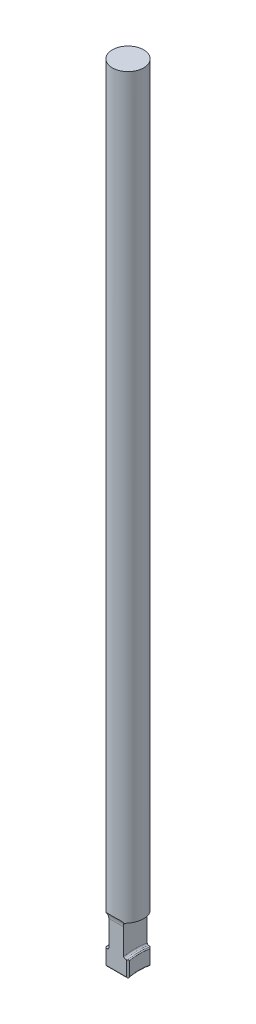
ISO-10303-21;
HEADER;
FILE_DESCRIPTION(('STEP AP214'),'2;1');
FILE_NAME('part.step','',(''),(''),'','','');
FILE_SCHEMA(('AUTOMOTIVE_DESIGN { 1 0 10303 214 1 1 1 1 }'));
ENDSEC;
DATA;
#1=APPLICATION_CONTEXT('core data for automotive mechanical design processes');
#2=APPLICATION_PROTOCOL_DEFINITION('international standard','automotive_design',2000,#1);
#3=PRODUCT_CONTEXT('',#1,'mechanical');
#4=PRODUCT('Part','Part','',(#3));
#5=PRODUCT_RELATED_PRODUCT_CATEGORY('part','',(#4));
#6=PRODUCT_DEFINITION_FORMATION('','',#4);
#7=PRODUCT_DEFINITION_CONTEXT('part definition',#1,'design');
#8=PRODUCT_DEFINITION('design','',#6,#7);
#9=PRODUCT_DEFINITION_SHAPE('','',#8);
#10=(LENGTH_UNIT() NAMED_UNIT(*) SI_UNIT(.MILLI.,.METRE.));
#11=(NAMED_UNIT(*) PLANE_ANGLE_UNIT() SI_UNIT($,.RADIAN.));
#12=(NAMED_UNIT(*) SI_UNIT($,.STERADIAN.) SOLID_ANGLE_UNIT());
#13=UNCERTAINTY_MEASURE_WITH_UNIT(LENGTH_MEASURE(1.E-05),#10,'distance_accuracy_value','');
#14=(GEOMETRIC_REPRESENTATION_CONTEXT(3) GLOBAL_UNCERTAINTY_ASSIGNED_CONTEXT((#13)) GLOBAL_UNIT_ASSIGNED_CONTEXT((#10,
#11,#12)) REPRESENTATION_CONTEXT('',''));
#15=CARTESIAN_POINT('',(0.,0.,0.));
#16=DIRECTION('',(0.,0.,1.));
#17=DIRECTION('',(1.,0.,0.));
#18=AXIS2_PLACEMENT_3D('',#15,#16,#17);
#19=CARTESIAN_POINT('',(2.286,0.,0.));
#20=DIRECTION('',(1.,0.,0.));
#21=DIRECTION('',(0.,0.,-1.));
#22=AXIS2_PLACEMENT_3D('',#19,#20,#21);
#23=TOROIDAL_SURFACE('',#22,16.381,0.381);
#24=CARTESIAN_POINT('',(2.286,15.7162336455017,3.));
#25=CARTESIAN_POINT('',(2.26483852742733,15.7162138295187,3.));
#26=CARTESIAN_POINT('',(2.24368479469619,15.7180272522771,3.));
#27=CARTESIAN_POINT('',(2.20200688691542,15.7251715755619,3.));
#28=CARTESIAN_POINT('',(2.18148193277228,15.7304979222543,3.));
#29=CARTESIAN_POINT('',(2.14161183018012,15.7445219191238,3.));
#30=CARTESIAN_POINT('',(2.12226704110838,15.7532205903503,3.));
#31=CARTESIAN_POINT('',(2.08529777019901,15.7737154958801,3.));
#32=CARTESIAN_POINT('',(2.06767323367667,15.7855116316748,3.));
#33=CARTESIAN_POINT('',(2.03448598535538,15.8119557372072,3.));
#34=CARTESIAN_POINT('',(2.01894051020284,15.8266253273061,3.));
#35=CARTESIAN_POINT('',(1.99048101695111,15.8583304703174,3.));
#36=CARTESIAN_POINT('',(1.97756759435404,15.875366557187,3.));
#37=CARTESIAN_POINT('',(1.95451065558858,15.9116241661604,3.));
#38=CARTESIAN_POINT('',(1.94441753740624,15.9308777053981,3.));
#39=CARTESIAN_POINT('',(1.92755440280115,15.9707855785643,3.));
#40=CARTESIAN_POINT('',(1.92078322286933,15.9914394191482,3.));
#41=CARTESIAN_POINT('',(1.91218275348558,16.0274736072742,3.));
#42=CARTESIAN_POINT('',(1.90949097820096,16.0426541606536,3.));
#43=CARTESIAN_POINT('',(1.90589964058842,16.0732042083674,3.));
#44=CARTESIAN_POINT('',(1.90499757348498,16.088573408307,3.));
#45=CARTESIAN_POINT('',(1.905,16.1039486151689,3.));
#46=B_SPLINE_CURVE_WITH_KNOTS('',3,(#24,#25,#26,#27,#28,#29,#30,#31,#32,#33,#34,#35,#36,#37,#38,
#39,#40,#41,#42,#43,#44,#45),.UNSPECIFIED.,.F.,.F.,(4,2,2,2,2,2,2,2,2,2,4),(0.,
0.0633953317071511,0.126708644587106,0.190041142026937,0.253371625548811,0.317198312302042,
0.381039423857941,0.445957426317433,0.510852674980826,0.557004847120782,0.603092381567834),.UNSPECIFIED.);
#47=CARTESIAN_POINT('',(2.286,15.7162336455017,3.));
#48=VERTEX_POINT('',#47);
#49=CARTESIAN_POINT('',(1.905,16.1039486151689,3.));
#50=VERTEX_POINT('',#49);
#51=EDGE_CURVE('E609',#48,#50,#46,.T.);
#52=ORIENTED_EDGE('',*,*,#51,.F.);
#53=CARTESIAN_POINT('',(2.286,0.,0.));
#54=DIRECTION('',(1.,0.,0.));
#55=DIRECTION('',(0.,0.,-1.));
#56=AXIS2_PLACEMENT_3D('',#53,#54,#55);
#57=CIRCLE('',#56,16.);
#58=CARTESIAN_POINT('',(2.286,15.7162336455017,-3.));
#59=VERTEX_POINT('',#58);
#60=EDGE_CURVE('E639',#59,#48,#57,.T.);
#61=ORIENTED_EDGE('',*,*,#60,.F.);
#62=CARTESIAN_POINT('',(1.905,16.1039486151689,-3.));
#63=CARTESIAN_POINT('',(1.90498313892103,16.0818581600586,-3.));
#64=CARTESIAN_POINT('',(1.90685583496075,16.0597712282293,-3.));
#65=CARTESIAN_POINT('',(1.91425675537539,16.0162247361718,-3.));
#66=CARTESIAN_POINT('',(1.91978390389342,15.9947649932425,-3.));
#67=CARTESIAN_POINT('',(1.93437489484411,15.9530662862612,-3.));
#68=CARTESIAN_POINT('',(1.94344097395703,15.9328281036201,-3.));
#69=CARTESIAN_POINT('',(1.96486395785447,15.8941821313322,-3.));
#70=CARTESIAN_POINT('',(1.97721984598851,15.8757737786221,-3.));
#71=CARTESIAN_POINT('',(2.00478592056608,15.8414646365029,-3.));
#72=CARTESIAN_POINT('',(2.01997366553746,15.8255458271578,-3.));
#73=CARTESIAN_POINT('',(2.05285036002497,15.7965326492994,-3.));
#74=CARTESIAN_POINT('',(2.07053969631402,15.7834387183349,-3.));
#75=CARTESIAN_POINT('',(2.10760244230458,15.7606829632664,-3.));
#76=CARTESIAN_POINT('',(2.12694358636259,15.7509685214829,-3.));
#77=CARTESIAN_POINT('',(2.16699486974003,15.734991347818,-3.));
#78=CARTESIAN_POINT('',(2.18770383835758,15.7287257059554,-3.));
#79=CARTESIAN_POINT('',(2.22147725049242,15.7216077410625,-3.));
#80=CARTESIAN_POINT('',(2.23430798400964,15.7195936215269,-3.));
#81=CARTESIAN_POINT('',(2.26009046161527,15.7169069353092,-3.));
#82=CARTESIAN_POINT('',(2.27304200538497,15.7162324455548,-3.));
#83=CARTESIAN_POINT('',(2.28599999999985,15.716233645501,-3.));
#84=B_SPLINE_CURVE_WITH_KNOTS('',3,(#62,#63,#64,#65,#66,#67,#68,#69,#70,#71,#72,#73,#74,#75,#76,
#77,#78,#79,#80,#81,#82,#83),.UNSPECIFIED.,.F.,.F.,(4,2,2,2,2,2,2,2,2,2,4),(0.,
0.0661875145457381,0.132355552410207,0.198565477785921,0.264754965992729,0.330440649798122,
0.396136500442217,0.460758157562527,0.525325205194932,0.564224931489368,0.603068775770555),.UNSPECIFIED.);
#85=CARTESIAN_POINT('',(1.905,16.1039486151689,-3.));
#86=VERTEX_POINT('',#85);
#87=EDGE_CURVE('E602',#86,#59,#84,.T.);
#88=ORIENTED_EDGE('',*,*,#87,.F.);
#89=CARTESIAN_POINT('',(1.905,0.,0.));
#90=DIRECTION('',(1.,0.,0.));
#91=DIRECTION('',(0.,0.,-1.));
#92=AXIS2_PLACEMENT_3D('',#89,#90,#91);
#93=CIRCLE('',#92,16.381);
#94=EDGE_CURVE('E642',#50,#86,#93,.F.);
#95=ORIENTED_EDGE('',*,*,#94,.F.);
#96=EDGE_LOOP('',(#52,#61,#88,#95));
#97=FACE_BOUND('',#96,.T.);
#98=ADVANCED_FACE('F38',(#97),#23,.F.);
#99=CARTESIAN_POINT('',(-2.286,0.,0.));
#100=DIRECTION('',(-1.,0.,0.));
#101=DIRECTION('',(0.,0.,1.));
#102=AXIS2_PLACEMENT_3D('',#99,#100,#101);
#103=TOROIDAL_SURFACE('',#102,16.381,0.381);
#104=CARTESIAN_POINT('',(-1.905,16.1039486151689,3.));
#105=CARTESIAN_POINT('',(-1.90498313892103,16.0818581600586,3.));
#106=CARTESIAN_POINT('',(-1.90685583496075,16.0597712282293,3.));
#107=CARTESIAN_POINT('',(-1.91425675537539,16.0162247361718,3.));
#108=CARTESIAN_POINT('',(-1.91978390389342,15.9947649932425,3.));
#109=CARTESIAN_POINT('',(-1.93437489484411,15.9530662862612,3.));
#110=CARTESIAN_POINT('',(-1.94344097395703,15.9328281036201,3.));
#111=CARTESIAN_POINT('',(-1.96486395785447,15.8941821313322,3.));
#112=CARTESIAN_POINT('',(-1.9772198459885,15.8757737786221,3.));
#113=CARTESIAN_POINT('',(-2.00478592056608,15.8414646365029,3.));
#114=CARTESIAN_POINT('',(-2.01997366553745,15.8255458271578,3.));
#115=CARTESIAN_POINT('',(-2.05285036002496,15.7965326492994,3.));
#116=CARTESIAN_POINT('',(-2.07053969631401,15.7834387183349,3.));
#117=CARTESIAN_POINT('',(-2.10760244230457,15.7606829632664,3.));
#118=CARTESIAN_POINT('',(-2.12694358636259,15.7509685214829,3.));
#119=CARTESIAN_POINT('',(-2.16699486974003,15.734991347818,3.));
#120=CARTESIAN_POINT('',(-2.18770383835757,15.7287257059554,3.));
#121=CARTESIAN_POINT('',(-2.22147725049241,15.7216077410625,3.));
#122=CARTESIAN_POINT('',(-2.23430798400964,15.7195936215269,3.));
#123=CARTESIAN_POINT('',(-2.26009046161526,15.7169069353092,3.));
#124=CARTESIAN_POINT('',(-2.27304200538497,15.7162324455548,3.));
#125=CARTESIAN_POINT('',(-2.28599999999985,15.716233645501,3.));
#126=B_SPLINE_CURVE_WITH_KNOTS('',3,(#104,#105,#106,#107,#108,#109,#110,#111,#112,#113,#114,
#115,#116,#117,#118,#119,#120,#121,#122,#123,#124,#125),.UNSPECIFIED.,.F.,.F.,(4,2,2,2,2,2,2,2,
2,2,4),(0.,0.0661875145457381,0.132355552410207,0.198565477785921,0.264754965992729,
0.330440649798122,0.396136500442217,0.460758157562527,0.525325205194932,0.564224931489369,
0.603068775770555),.UNSPECIFIED.);
#127=CARTESIAN_POINT('',(-1.905,16.1039486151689,3.));
#128=VERTEX_POINT('',#127);
#129=CARTESIAN_POINT('',(-2.286,15.7162336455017,3.));
#130=VERTEX_POINT('',#129);
#131=EDGE_CURVE('E627',#128,#130,#126,.T.);
#132=ORIENTED_EDGE('',*,*,#131,.F.);
#133=CARTESIAN_POINT('',(-1.905,0.,0.));
#134=DIRECTION('',(-1.,0.,0.));
#135=DIRECTION('',(0.,0.,1.));
#136=AXIS2_PLACEMENT_3D('',#133,#134,#135);
#137=CIRCLE('',#136,16.381);
#138=CARTESIAN_POINT('',(-1.905,16.1039486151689,-3.));
#139=VERTEX_POINT('',#138);
#140=EDGE_CURVE('E645',#139,#128,#137,.F.);
#141=ORIENTED_EDGE('',*,*,#140,.F.);
#142=CARTESIAN_POINT('',(-2.286,15.7162336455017,-3.));
#143=CARTESIAN_POINT('',(-2.26483852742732,15.7162138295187,-3.));
#144=CARTESIAN_POINT('',(-2.24368479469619,15.7180272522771,-3.));
#145=CARTESIAN_POINT('',(-2.20200688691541,15.7251715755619,-3.));
#146=CARTESIAN_POINT('',(-2.18148193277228,15.7304979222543,-3.));
#147=CARTESIAN_POINT('',(-2.14161183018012,15.7445219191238,-3.));
#148=CARTESIAN_POINT('',(-2.12226704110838,15.7532205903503,-3.));
#149=CARTESIAN_POINT('',(-2.08529777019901,15.7737154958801,-3.));
#150=CARTESIAN_POINT('',(-2.06767323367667,15.7855116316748,-3.));
#151=CARTESIAN_POINT('',(-2.03448598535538,15.8119557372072,-3.));
#152=CARTESIAN_POINT('',(-2.01894051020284,15.8266253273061,-3.));
#153=CARTESIAN_POINT('',(-1.99048101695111,15.8583304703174,-3.));
#154=CARTESIAN_POINT('',(-1.97756759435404,15.875366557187,-3.));
#155=CARTESIAN_POINT('',(-1.95451065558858,15.9116241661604,-3.));
#156=CARTESIAN_POINT('',(-1.94441753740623,15.9308777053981,-3.));
#157=CARTESIAN_POINT('',(-1.92755440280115,15.9707855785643,-3.));
#158=CARTESIAN_POINT('',(-1.92078322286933,15.9914394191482,-3.));
#159=CARTESIAN_POINT('',(-1.91218275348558,16.0274736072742,-3.));
#160=CARTESIAN_POINT('',(-1.90949097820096,16.0426541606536,-3.));
#161=CARTESIAN_POINT('',(-1.90589964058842,16.0732042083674,-3.));
#162=CARTESIAN_POINT('',(-1.90499757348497,16.088573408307,-3.));
#163=CARTESIAN_POINT('',(-1.905,16.1039486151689,-3.));
#164=B_SPLINE_CURVE_WITH_KNOTS('',3,(#142,#143,#144,#145,#146,#147,#148,#149,#150,#151,#152,
#153,#154,#155,#156,#157,#158,#159,#160,#161,#162,#163),.UNSPECIFIED.,.F.,.F.,(4,2,2,2,2,2,2,2,
2,2,4),(0.,0.0633953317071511,0.126708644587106,0.190041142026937,0.253371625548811,
0.317198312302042,0.381039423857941,0.445957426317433,0.510852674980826,0.557004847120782,
0.603092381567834),.UNSPECIFIED.);
#165=CARTESIAN_POINT('',(-2.286,15.7162336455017,-3.));
#166=VERTEX_POINT('',#165);
#167=EDGE_CURVE('E633',#166,#139,#164,.T.);
#168=ORIENTED_EDGE('',*,*,#167,.F.);
#169=CARTESIAN_POINT('',(-2.286,0.,0.));
#170=DIRECTION('',(-1.,0.,0.));
#171=DIRECTION('',(0.,0.,1.));
#172=AXIS2_PLACEMENT_3D('',#169,#170,#171);
#173=CIRCLE('',#172,16.);
#174=EDGE_CURVE('E647',#130,#166,#173,.T.);
#175=ORIENTED_EDGE('',*,*,#174,.F.);
#176=EDGE_LOOP('',(#132,#141,#168,#175));
#177=FACE_BOUND('',#176,.T.);
#178=ADVANCED_FACE('F588',(#177),#103,.F.);
#179=CARTESIAN_POINT('',(-1.905,16.,0.));
#180=DIRECTION('',(-1.,0.,0.));
#181=DIRECTION('',(0.,0.,1.));
#182=AXIS2_PLACEMENT_3D('',#179,#180,#181);
#183=PLANE('',#182);
#184=DIRECTION('',(0.,1.,0.));
#185=VECTOR('',#184,1.);
#186=CARTESIAN_POINT('',(-1.905,16.,-3.));
#187=LINE('',#186,#185);
#188=CARTESIAN_POINT('',(-1.905,22.6124,-3.));
#189=VERTEX_POINT('',#188);
#190=EDGE_CURVE('E308',#139,#189,#187,.T.);
#191=ORIENTED_EDGE('',*,*,#190,.F.);
#192=ORIENTED_EDGE('',*,*,#140,.T.);
#193=DIRECTION('',(0.,-1.,0.));
#194=VECTOR('',#193,1.);
#195=CARTESIAN_POINT('',(-1.905,16.,3.));
#196=LINE('',#195,#194);
#197=CARTESIAN_POINT('',(-1.905,22.6124,3.));
#198=VERTEX_POINT('',#197);
#199=EDGE_CURVE('E300',#198,#128,#196,.T.);
#200=ORIENTED_EDGE('',*,*,#199,.F.);
#201=CARTESIAN_POINT('',(-1.905,22.6124,5.3876));
#202=DIRECTION('',(-1.,0.,0.));
#203=DIRECTION('',(0.,0.,1.));
#204=AXIS2_PLACEMENT_3D('',#201,#202,#203);
#205=CIRCLE('',#204,2.3876);
#206=CARTESIAN_POINT('',(-1.905,23.0385151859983,3.03833211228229));
#207=VERTEX_POINT('',#206);
#208=EDGE_CURVE('E288',#207,#198,#205,.T.);
#209=ORIENTED_EDGE('',*,*,#208,.F.);
#210=CARTESIAN_POINT('',(-1.905,0.,0.));
#211=DIRECTION('',(-1.,0.,0.));
#212=DIRECTION('',(0.,0.,1.));
#213=AXIS2_PLACEMENT_3D('',#210,#211,#212);
#214=CIRCLE('',#213,23.238);
#215=CARTESIAN_POINT('',(-1.905,23.0385151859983,-3.03833211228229));
#216=VERTEX_POINT('',#215);
#217=EDGE_CURVE('E315',#207,#216,#214,.T.);
#218=ORIENTED_EDGE('',*,*,#217,.T.);
#219=CARTESIAN_POINT('',(-1.905,22.6124,-5.3876));
#220=DIRECTION('',(-1.,0.,0.));
#221=DIRECTION('',(0.,0.,1.));
#222=AXIS2_PLACEMENT_3D('',#219,#220,#221);
#223=CIRCLE('',#222,2.3876);
#224=EDGE_CURVE('E292',#189,#216,#223,.T.);
#225=ORIENTED_EDGE('',*,*,#224,.F.);
#226=EDGE_LOOP('',(#191,#192,#200,#209,#218,#225));
#227=FACE_BOUND('',#226,.T.);
#228=ADVANCED_FACE('F584',(#227),#183,.T.);
#229=CARTESIAN_POINT('',(1.905,16.,0.));
#230=DIRECTION('',(1.,0.,0.));
#231=DIRECTION('',(0.,0.,-1.));
#232=AXIS2_PLACEMENT_3D('',#229,#230,#231);
#233=PLANE('',#232);
#234=DIRECTION('',(0.,1.,0.));
#235=VECTOR('',#234,1.);
#236=CARTESIAN_POINT('',(1.905,16.,3.));
#237=LINE('',#236,#235);
#238=CARTESIAN_POINT('',(1.905,22.6124,3.));
#239=VERTEX_POINT('',#238);
#240=EDGE_CURVE('E295',#50,#239,#237,.T.);
#241=ORIENTED_EDGE('',*,*,#240,.F.);
#242=ORIENTED_EDGE('',*,*,#94,.T.);
#243=DIRECTION('',(0.,-1.,0.));
#244=VECTOR('',#243,1.);
#245=CARTESIAN_POINT('',(1.905,16.,-3.));
#246=LINE('',#245,#244);
#247=CARTESIAN_POINT('',(1.905,22.6124,-3.));
#248=VERTEX_POINT('',#247);
#249=EDGE_CURVE('E303',#248,#86,#246,.T.);
#250=ORIENTED_EDGE('',*,*,#249,.F.);
#251=CARTESIAN_POINT('',(1.905,22.6124,-5.3876));
#252=DIRECTION('',(1.,0.,0.));
#253=DIRECTION('',(0.,0.,-1.));
#254=AXIS2_PLACEMENT_3D('',#251,#252,#253);
#255=CIRCLE('',#254,2.3876);
#256=CARTESIAN_POINT('',(1.905,23.0385151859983,-3.03833211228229));
#257=VERTEX_POINT('',#256);
#258=EDGE_CURVE('E290',#257,#248,#255,.T.);
#259=ORIENTED_EDGE('',*,*,#258,.F.);
#260=CARTESIAN_POINT('',(1.905,0.,0.));
#261=DIRECTION('',(1.,0.,0.));
#262=DIRECTION('',(0.,0.,-1.));
#263=AXIS2_PLACEMENT_3D('',#260,#261,#262);
#264=CIRCLE('',#263,23.238);
#265=CARTESIAN_POINT('',(1.905,23.0385151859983,3.03833211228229));
#266=VERTEX_POINT('',#265);
#267=EDGE_CURVE('E324',#257,#266,#264,.T.);
#268=ORIENTED_EDGE('',*,*,#267,.T.);
#269=CARTESIAN_POINT('',(1.905,22.6124,5.3876));
#270=DIRECTION('',(1.,0.,0.));
#271=DIRECTION('',(0.,0.,-1.));
#272=AXIS2_PLACEMENT_3D('',#269,#270,#271);
#273=CIRCLE('',#272,2.3876);
#274=EDGE_CURVE('E283',#239,#266,#273,.T.);
#275=ORIENTED_EDGE('',*,*,#274,.F.);
#276=EDGE_LOOP('',(#241,#242,#250,#259,#268,#275));
#277=FACE_BOUND('',#276,.T.);
#278=ADVANCED_FACE('F579',(#277),#233,.T.);
#279=CARTESIAN_POINT('',(-5.588,0.,0.));
#280=DIRECTION('',(1.,0.,0.));
#281=DIRECTION('',(0.,0.,-1.));
#282=AXIS2_PLACEMENT_3D('',#279,#280,#281);
#283=CYLINDRICAL_SURFACE('',#282,12.);
#284=CARTESIAN_POINT('',(-2.746,0.,0.));
#285=DIRECTION('',(1.,0.,0.));
#286=DIRECTION('',(0.,1.,0.));
#287=AXIS2_PLACEMENT_3D('',#284,#285,#286);
#288=CIRCLE('',#287,12.);
#289=CARTESIAN_POINT('',(-2.746,11.6948211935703,2.68908111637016));
#290=VERTEX_POINT('',#289);
#291=CARTESIAN_POINT('',(-2.746,11.6948211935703,-2.68908111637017));
#292=VERTEX_POINT('',#291);
#293=EDGE_CURVE('E750',#290,#292,#288,.F.);
#294=ORIENTED_EDGE('',*,*,#293,.T.);
#295=DIRECTION('',(1.,0.,0.));
#296=VECTOR('',#295,1.);
#297=CARTESIAN_POINT('',(-5.588,11.6948211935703,-2.68908111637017));
#298=LINE('',#297,#296);
#299=CARTESIAN_POINT('',(2.746,11.6948211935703,-2.68908111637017));
#300=VERTEX_POINT('',#299);
#301=EDGE_CURVE('E757',#292,#300,#298,.T.);
#302=ORIENTED_EDGE('',*,*,#301,.T.);
#303=CARTESIAN_POINT('',(2.746,0.,0.));
#304=DIRECTION('',(-1.,0.,0.));
#305=DIRECTION('',(0.,-1.,0.));
#306=AXIS2_PLACEMENT_3D('',#303,#304,#305);
#307=CIRCLE('',#306,12.);
#308=CARTESIAN_POINT('',(2.746,11.6948211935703,2.68908111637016));
#309=VERTEX_POINT('',#308);
#310=EDGE_CURVE('E754',#300,#309,#307,.F.);
#311=ORIENTED_EDGE('',*,*,#310,.T.);
#312=DIRECTION('',(1.,0.,0.));
#313=VECTOR('',#312,1.);
#314=CARTESIAN_POINT('',(-5.588,11.6948211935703,2.68908111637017));
#315=LINE('',#314,#313);
#316=EDGE_CURVE('E746',#309,#290,#315,.F.);
#317=ORIENTED_EDGE('',*,*,#316,.T.);
#318=EDGE_LOOP('',(#294,#302,#311,#317));
#319=FACE_BOUND('',#318,.T.);
#320=ADVANCED_FACE('F352',(#319),#283,.F.);
#321=CARTESIAN_POINT('',(-2.667,0.,0.));
#322=DIRECTION('',(-1.,0.,0.));
#323=DIRECTION('',(0.,0.,1.));
#324=AXIS2_PLACEMENT_3D('',#321,#322,#323);
#325=TOROIDAL_SURFACE('',#324,23.238,0.762);
#326=CARTESIAN_POINT('',(-1.91846141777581,23.1156402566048,-3.50991535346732));
#327=CARTESIAN_POINT('',(-1.92597253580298,23.1563069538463,-3.50579847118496));
#328=CARTESIAN_POINT('',(-1.93658926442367,23.196140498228,-3.49997651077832));
#329=CARTESIAN_POINT('',(-1.96322543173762,23.2732571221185,-3.48511083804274));
#330=CARTESIAN_POINT('',(-1.97923573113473,23.310544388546,-3.47607257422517));
#331=CARTESIAN_POINT('',(-2.01949710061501,23.388860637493,-3.45286314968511));
#332=CARTESIAN_POINT('',(-2.04475092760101,23.4291758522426,-3.43803102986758));
#333=CARTESIAN_POINT('',(-2.10034345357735,23.5041295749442,-3.40435105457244));
#334=CARTESIAN_POINT('',(-2.13067523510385,23.5387756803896,-3.38550865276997));
#335=CARTESIAN_POINT('',(-2.17134097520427,23.5787674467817,-3.35937267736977));
#336=CARTESIAN_POINT('',(-2.1800413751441,23.5869797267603,-3.35373436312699));
#337=CARTESIAN_POINT('',(-2.23210761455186,23.6341818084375,-3.31969096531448));
#338=CARTESIAN_POINT('',(-2.27823264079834,23.6681919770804,-3.28832001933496));
#339=CARTESIAN_POINT('',(-2.37330982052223,23.725623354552,-3.22037822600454));
#340=CARTESIAN_POINT('',(-2.42227278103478,23.7490006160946,-3.18378660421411));
#341=CARTESIAN_POINT('',(-2.5122843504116,23.7824661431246,-3.11305827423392));
#342=CARTESIAN_POINT('',(-2.55326307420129,23.7941381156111,-3.07956206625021));
#343=CARTESIAN_POINT('',(-2.63454359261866,23.8108897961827,-3.01031986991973));
#344=CARTESIAN_POINT('',(-2.67484627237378,23.8159789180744,-2.97457717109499));
#345=CARTESIAN_POINT('',(-2.74783071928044,23.8197087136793,-2.90714430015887));
#346=CARTESIAN_POINT('',(-2.78070878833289,23.8192427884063,-2.87570849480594));
#347=CARTESIAN_POINT('',(-2.84518617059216,23.8141789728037,-2.81193652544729));
#348=CARTESIAN_POINT('',(-2.8767867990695,23.8095854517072,-2.77960134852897));
#349=CARTESIAN_POINT('',(-2.90762146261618,23.8030318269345,-2.74695056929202));
#350=B_SPLINE_CURVE_WITH_KNOTS('',3,(#326,#327,#328,#329,#330,#331,#332,#333,#334,#335,#336,
#337,#338,#339,#340,#341,#342,#343,#344,#345,#346,#347,#348,#349),.UNSPECIFIED.,.F.,.F.,(4,2,2,
2,2,2,2,2,2,2,2,4),(0.,0.124395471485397,0.248581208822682,0.397274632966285,0.545767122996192,
0.585444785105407,0.779988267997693,0.975328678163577,1.13745461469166,1.29934844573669,
1.43560981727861,1.57172712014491),.UNSPECIFIED.);
#351=CARTESIAN_POINT('',(-2.31974200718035,23.6932347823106,-3.25864957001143));
#352=VERTEX_POINT('',#351);
#353=CARTESIAN_POINT('',(-2.66700000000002,23.8141321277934,-2.98112579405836));
#354=VERTEX_POINT('',#353);
#355=EDGE_CURVE('E362',#352,#354,#350,.T.);
#356=ORIENTED_EDGE('',*,*,#355,.F.);
#357=CARTESIAN_POINT('',(-1.905,23.0385151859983,-3.03833211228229));
#358=CARTESIAN_POINT('',(-1.90496142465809,23.0800496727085,-3.04582495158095));
#359=CARTESIAN_POINT('',(-1.90849535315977,23.1213303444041,-3.054489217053));
#360=CARTESIAN_POINT('',(-1.92233286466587,23.2021835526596,-3.07362964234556));
#361=CARTESIAN_POINT('',(-1.93261685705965,23.2417606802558,-3.08410049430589));
#362=CARTESIAN_POINT('',(-1.95957545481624,23.3182371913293,-3.10636596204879));
#363=CARTESIAN_POINT('',(-1.97624644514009,23.3551380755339,-3.11815982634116));
#364=CARTESIAN_POINT('',(-2.01545075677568,23.4254662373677,-3.14239644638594));
#365=CARTESIAN_POINT('',(-2.03798759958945,23.4588914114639,-3.15483958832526));
#366=CARTESIAN_POINT('',(-2.08919258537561,23.5226220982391,-3.18003450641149));
#367=CARTESIAN_POINT('',(-2.11804373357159,23.5527822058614,-3.19278232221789));
#368=CARTESIAN_POINT('',(-2.18068244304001,23.607972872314,-3.21725869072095));
#369=CARTESIAN_POINT('',(-2.21447129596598,23.633002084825,-3.22898697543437));
#370=CARTESIAN_POINT('',(-2.28692923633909,23.6777883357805,-3.25072942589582));
#371=CARTESIAN_POINT('',(-2.32568491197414,23.6974254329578,-3.26070305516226));
#372=CARTESIAN_POINT('',(-2.40645623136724,23.7301228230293,-3.27770155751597));
#373=CARTESIAN_POINT('',(-2.44846773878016,23.7431913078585,-3.28473010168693));
#374=CARTESIAN_POINT('',(-2.52011875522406,23.7591190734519,-3.29338831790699));
#375=CARTESIAN_POINT('',(-2.54921721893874,23.7639290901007,-3.29603653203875));
#376=CARTESIAN_POINT('',(-2.60787020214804,23.7703600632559,-3.29959472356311));
#377=CARTESIAN_POINT('',(-2.63742475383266,23.7719807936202,-3.30050457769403));
#378=CARTESIAN_POINT('',(-2.667,23.7719741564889,-3.3004915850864));
#379=B_SPLINE_CURVE_WITH_KNOTS('',3,(#357,#358,#359,#360,#361,#362,#363,#364,#365,#366,#367,
#368,#369,#370,#371,#372,#373,#374,#375,#376,#377,#378),.UNSPECIFIED.,.F.,.F.,(4,2,2,2,2,2,2,2,
2,2,4),(0.,0.126389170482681,0.25241313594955,0.378365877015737,0.504394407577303,
0.634724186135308,0.76508811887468,0.898152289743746,1.03105009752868,1.11967330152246,
1.20830278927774),.UNSPECIFIED.);
#380=EDGE_CURVE('E326',#216,#352,#379,.T.);
#381=ORIENTED_EDGE('',*,*,#380,.F.);
#382=ORIENTED_EDGE('',*,*,#217,.F.);
#383=CARTESIAN_POINT('',(-2.667,23.7719741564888,3.3004915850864));
#384=CARTESIAN_POINT('',(-2.62570561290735,23.7720095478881,3.30054623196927));
#385=CARTESIAN_POINT('',(-2.58445319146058,23.7688309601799,3.29874524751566));
#386=CARTESIAN_POINT('',(-2.50330653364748,23.7563407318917,3.29186100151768));
#387=CARTESIAN_POINT('',(-2.46340816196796,23.7470499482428,3.28678890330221));
#388=CARTESIAN_POINT('',(-2.38597312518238,23.7226345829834,3.27379029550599));
#389=CARTESIAN_POINT('',(-2.34843495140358,23.7075137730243,3.26586563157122));
#390=CARTESIAN_POINT('',(-2.27656689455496,23.6718664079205,3.24784175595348));
#391=CARTESIAN_POINT('',(-2.24223932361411,23.651335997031,3.23774099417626));
#392=CARTESIAN_POINT('',(-2.17626612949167,23.6044267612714,3.21568550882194));
#393=CARTESIAN_POINT('',(-2.14478322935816,23.5778464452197,3.20367268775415));
#394=CARTESIAN_POINT('',(-2.08683665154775,23.5199347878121,3.17897949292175));
#395=CARTESIAN_POINT('',(-2.06037440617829,23.4886020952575,3.16629892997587));
#396=CARTESIAN_POINT('',(-2.01221432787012,23.4205459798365,3.14062306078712));
#397=CARTESIAN_POINT('',(-1.99074076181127,23.3836607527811,3.12763459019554));
#398=CARTESIAN_POINT('',(-1.95461834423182,23.306376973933,3.10272069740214));
#399=CARTESIAN_POINT('',(-1.93996308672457,23.2659817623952,3.09079428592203));
#400=CARTESIAN_POINT('',(-1.92106478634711,23.194342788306,3.07179723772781));
#401=CARTESIAN_POINT('',(-1.91506150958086,23.1636666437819,3.064297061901));
#402=CARTESIAN_POINT('',(-1.90702361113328,23.1015463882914,3.05042273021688));
#403=CARTESIAN_POINT('',(-1.90498954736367,23.0701021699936,3.04404873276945));
#404=CARTESIAN_POINT('',(-1.905,23.0385151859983,3.03833211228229));
#405=B_SPLINE_CURVE_WITH_KNOTS('',3,(#383,#384,#385,#386,#387,#388,#389,#390,#391,#392,#393,
#394,#395,#396,#397,#398,#399,#400,#401,#402,#403,#404),.UNSPECIFIED.,.F.,.F.,(4,2,2,2,2,2,2,2,
2,2,4),(0.,0.123656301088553,0.246892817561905,0.370049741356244,0.493294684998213,
0.621481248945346,0.749704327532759,0.882894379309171,1.01595904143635,1.11213377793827,
1.20832203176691),.UNSPECIFIED.);
#406=CARTESIAN_POINT('',(-2.31974200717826,23.6932347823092,3.25864957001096));
#407=VERTEX_POINT('',#406);
#408=EDGE_CURVE('E335',#407,#207,#405,.T.);
#409=ORIENTED_EDGE('',*,*,#408,.F.);
#410=CARTESIAN_POINT('',(-2.90785795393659,23.802981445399,2.74670022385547));
#411=CARTESIAN_POINT('',(-2.87703232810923,23.8095431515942,2.77934587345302));
#412=CARTESIAN_POINT('',(-2.84544666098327,23.8141462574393,2.81167220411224));
#413=CARTESIAN_POINT('',(-2.78089792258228,23.8192401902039,2.87552803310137));
#414=CARTESIAN_POINT('',(-2.74792962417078,23.8197136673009,2.90705361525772));
#415=CARTESIAN_POINT('',(-2.66711996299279,23.8155842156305,2.98171479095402));
#416=CARTESIAN_POINT('',(-2.61879117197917,23.8087900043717,3.02423097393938));
#417=CARTESIAN_POINT('',(-2.52151171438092,23.7857093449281,3.10580053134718));
#418=CARTESIAN_POINT('',(-2.47256179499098,23.769433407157,3.14485768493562));
#419=CARTESIAN_POINT('',(-2.38347019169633,23.730119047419,3.21273964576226));
#420=CARTESIAN_POINT('',(-2.34316384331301,23.7085643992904,3.24220452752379));
#421=CARTESIAN_POINT('',(-2.26472508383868,23.6580184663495,3.29747127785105));
#422=CARTESIAN_POINT('',(-2.22659170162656,23.6290305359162,3.32327479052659));
#423=CARTESIAN_POINT('',(-2.15812261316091,23.5672372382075,3.3680853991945));
#424=CARTESIAN_POINT('',(-2.12738987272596,23.5351893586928,3.38752638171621));
#425=CARTESIAN_POINT('',(-2.07036784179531,23.4656326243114,3.42267406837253));
#426=CARTESIAN_POINT('',(-2.0440717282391,23.4281323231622,3.43838652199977));
#427=CARTESIAN_POINT('',(-1.99662481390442,23.3472113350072,3.46616069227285));
#428=CARTESIAN_POINT('',(-1.9756304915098,23.3036590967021,3.47811349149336));
#429=CARTESIAN_POINT('',(-1.94975044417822,23.2353381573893,3.49264544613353));
#430=CARTESIAN_POINT('',(-1.94203916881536,23.2119641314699,3.49693367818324));
#431=CARTESIAN_POINT('',(-1.92867915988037,23.1644285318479,3.50431903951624));
#432=CARTESIAN_POINT('',(-1.92303233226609,23.1402662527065,3.50741506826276));
#433=CARTESIAN_POINT('',(-1.91849348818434,23.1158130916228,3.50989782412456));
#434=B_SPLINE_CURVE_WITH_KNOTS('',3,(#410,#411,#412,#413,#414,#415,#416,#417,#418,#419,#420,
#421,#422,#423,#424,#425,#426,#427,#428,#429,#430,#431,#432,#433),.UNSPECIFIED.,.F.,.F.,(4,2,2,
2,2,2,2,2,2,2,2,4),(0.,0.136077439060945,0.272726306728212,0.46616013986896,0.659379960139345,
0.821925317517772,0.984397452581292,1.12920854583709,1.27379486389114,1.42224941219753,
1.49709019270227,1.57199989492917),.UNSPECIFIED.);
#435=CARTESIAN_POINT('',(-2.667,23.8141321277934,2.98112579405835));
#436=VERTEX_POINT('',#435);
#437=EDGE_CURVE('E257',#436,#407,#434,.T.);
#438=ORIENTED_EDGE('',*,*,#437,.F.);
#439=CARTESIAN_POINT('',(-2.667,0.,0.));
#440=DIRECTION('',(-1.,0.,0.));
#441=DIRECTION('',(0.,0.,1.));
#442=AXIS2_PLACEMENT_3D('',#439,#440,#441);
#443=CIRCLE('',#442,24.);
#444=EDGE_CURVE('E318',#354,#436,#443,.F.);
#445=ORIENTED_EDGE('',*,*,#444,.F.);
#446=EDGE_LOOP('',(#356,#381,#382,#409,#438,#445));
#447=FACE_BOUND('',#446,.T.);
#448=ADVANCED_FACE('F346',(#447),#325,.F.);
#449=CARTESIAN_POINT('',(2.667,0.,0.));
#450=DIRECTION('',(1.,0.,0.));
#451=DIRECTION('',(0.,0.,-1.));
#452=AXIS2_PLACEMENT_3D('',#449,#450,#451);
#453=TOROIDAL_SURFACE('',#452,23.238,0.762);
#454=CARTESIAN_POINT('',(1.91846141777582,23.1156402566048,3.50991535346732));
#455=CARTESIAN_POINT('',(1.92597253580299,23.1563069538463,3.50579847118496));
#456=CARTESIAN_POINT('',(1.93658926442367,23.196140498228,3.49997651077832));
#457=CARTESIAN_POINT('',(1.96322543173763,23.2732571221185,3.48511083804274));
#458=CARTESIAN_POINT('',(1.97923573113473,23.310544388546,3.47607257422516));
#459=CARTESIAN_POINT('',(2.01949710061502,23.388860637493,3.45286314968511));
#460=CARTESIAN_POINT('',(2.04475092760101,23.4291758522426,3.43803102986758));
#461=CARTESIAN_POINT('',(2.10034345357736,23.5041295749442,3.40435105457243));
#462=CARTESIAN_POINT('',(2.13067523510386,23.5387756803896,3.38550865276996));
#463=CARTESIAN_POINT('',(2.17134097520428,23.5787674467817,3.35937267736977));
#464=CARTESIAN_POINT('',(2.1800413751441,23.5869797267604,3.35373436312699));
#465=CARTESIAN_POINT('',(2.23210761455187,23.6341818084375,3.31969096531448));
#466=CARTESIAN_POINT('',(2.27823264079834,23.6681919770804,3.28832001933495));
#467=CARTESIAN_POINT('',(2.37330982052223,23.725623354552,3.22037822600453));
#468=CARTESIAN_POINT('',(2.42227278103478,23.7490006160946,3.1837866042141));
#469=CARTESIAN_POINT('',(2.51228435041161,23.7824661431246,3.11305827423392));
#470=CARTESIAN_POINT('',(2.5532630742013,23.7941381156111,3.07956206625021));
#471=CARTESIAN_POINT('',(2.63454359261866,23.8108897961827,3.01031986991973));
#472=CARTESIAN_POINT('',(2.67484627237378,23.8159789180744,2.97457717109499));
#473=CARTESIAN_POINT('',(2.74783071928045,23.8197087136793,2.90714430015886));
#474=CARTESIAN_POINT('',(2.7807087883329,23.8192427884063,2.87570849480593));
#475=CARTESIAN_POINT('',(2.84518617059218,23.8141789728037,2.81193652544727));
#476=CARTESIAN_POINT('',(2.87678679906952,23.8095854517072,2.77960134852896));
#477=CARTESIAN_POINT('',(2.9076214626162,23.8030318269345,2.746950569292));
#478=B_SPLINE_CURVE_WITH_KNOTS('',3,(#454,#455,#456,#457,#458,#459,#460,#461,#462,#463,#464,
#465,#466,#467,#468,#469,#470,#471,#472,#473,#474,#475,#476,#477),.UNSPECIFIED.,.F.,.F.,(4,2,2,
2,2,2,2,2,2,2,2,4),(0.,0.124395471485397,0.248581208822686,0.397274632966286,0.545767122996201,
0.585444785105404,0.779988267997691,0.975328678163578,1.13745461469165,1.29934844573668,
1.43560981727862,1.57172712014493),.UNSPECIFIED.);
#479=CARTESIAN_POINT('',(2.31974200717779,23.6932347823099,3.25864957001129));
#480=VERTEX_POINT('',#479);
#481=CARTESIAN_POINT('',(2.667,23.8141321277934,2.98112579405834));
#482=VERTEX_POINT('',#481);
#483=EDGE_CURVE('E370',#480,#482,#478,.T.);
#484=ORIENTED_EDGE('',*,*,#483,.F.);
#485=CARTESIAN_POINT('',(1.905,23.0385151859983,3.03833211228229));
#486=CARTESIAN_POINT('',(1.90496142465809,23.0800496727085,3.04582495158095));
#487=CARTESIAN_POINT('',(1.90849535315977,23.1213303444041,3.054489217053));
#488=CARTESIAN_POINT('',(1.92233286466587,23.2021835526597,3.07362964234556));
#489=CARTESIAN_POINT('',(1.93261685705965,23.2417606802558,3.08410049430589));
#490=CARTESIAN_POINT('',(1.95957545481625,23.3182371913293,3.10636596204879));
#491=CARTESIAN_POINT('',(1.97624644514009,23.3551380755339,3.11815982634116));
#492=CARTESIAN_POINT('',(2.01545075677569,23.4254662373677,3.14239644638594));
#493=CARTESIAN_POINT('',(2.03798759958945,23.4588914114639,3.15483958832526));
#494=CARTESIAN_POINT('',(2.08919258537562,23.5226220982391,3.18003450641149));
#495=CARTESIAN_POINT('',(2.11804373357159,23.5527822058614,3.19278232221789));
#496=CARTESIAN_POINT('',(2.18068244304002,23.607972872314,3.21725869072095));
#497=CARTESIAN_POINT('',(2.21447129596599,23.633002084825,3.22898697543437));
#498=CARTESIAN_POINT('',(2.28692923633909,23.6777883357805,3.25072942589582));
#499=CARTESIAN_POINT('',(2.32568491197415,23.6974254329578,3.26070305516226));
#500=CARTESIAN_POINT('',(2.40645623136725,23.7301228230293,3.27770155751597));
#501=CARTESIAN_POINT('',(2.44846773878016,23.7431913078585,3.28473010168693));
#502=CARTESIAN_POINT('',(2.52011875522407,23.7591190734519,3.29338831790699));
#503=CARTESIAN_POINT('',(2.54921721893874,23.7639290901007,3.29603653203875));
#504=CARTESIAN_POINT('',(2.60787020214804,23.7703600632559,3.29959472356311));
#505=CARTESIAN_POINT('',(2.63742475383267,23.7719807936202,3.30050457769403));
#506=CARTESIAN_POINT('',(2.667,23.7719741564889,3.3004915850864));
#507=B_SPLINE_CURVE_WITH_KNOTS('',3,(#485,#486,#487,#488,#489,#490,#491,#492,#493,#494,#495,
#496,#497,#498,#499,#500,#501,#502,#503,#504,#505,#506),.UNSPECIFIED.,.F.,.F.,(4,2,2,2,2,2,2,2,
2,2,4),(0.,0.126389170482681,0.252413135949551,0.378365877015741,0.504394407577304,
0.634724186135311,0.765088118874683,0.898152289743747,1.03105009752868,1.11967330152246,
1.20830278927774),.UNSPECIFIED.);
#508=EDGE_CURVE('E650',#266,#480,#507,.T.);
#509=ORIENTED_EDGE('',*,*,#508,.F.);
#510=ORIENTED_EDGE('',*,*,#267,.F.);
#511=CARTESIAN_POINT('',(2.667,23.7719741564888,-3.3004915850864));
#512=CARTESIAN_POINT('',(2.62570561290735,23.7720095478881,-3.30054623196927));
#513=CARTESIAN_POINT('',(2.58445319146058,23.7688309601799,-3.29874524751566));
#514=CARTESIAN_POINT('',(2.50330653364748,23.7563407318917,-3.29186100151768));
#515=CARTESIAN_POINT('',(2.46340816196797,23.7470499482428,-3.28678890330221));
#516=CARTESIAN_POINT('',(2.38597312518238,23.7226345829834,-3.27379029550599));
#517=CARTESIAN_POINT('',(2.34843495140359,23.7075137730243,-3.26586563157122));
#518=CARTESIAN_POINT('',(2.27656689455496,23.6718664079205,-3.24784175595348));
#519=CARTESIAN_POINT('',(2.24223932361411,23.651335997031,-3.23774099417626));
#520=CARTESIAN_POINT('',(2.17626612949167,23.6044267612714,-3.21568550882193));
#521=CARTESIAN_POINT('',(2.14478322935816,23.5778464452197,-3.20367268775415));
#522=CARTESIAN_POINT('',(2.08683665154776,23.5199347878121,-3.17897949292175));
#523=CARTESIAN_POINT('',(2.06037440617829,23.4886020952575,-3.16629892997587));
#524=CARTESIAN_POINT('',(2.01221432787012,23.4205459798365,-3.14062306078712));
#525=CARTESIAN_POINT('',(1.99074076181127,23.3836607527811,-3.12763459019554));
#526=CARTESIAN_POINT('',(1.95461834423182,23.306376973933,-3.10272069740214));
#527=CARTESIAN_POINT('',(1.93996308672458,23.2659817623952,-3.09079428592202));
#528=CARTESIAN_POINT('',(1.92106478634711,23.194342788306,-3.07179723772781));
#529=CARTESIAN_POINT('',(1.91506150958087,23.1636666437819,-3.064297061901));
#530=CARTESIAN_POINT('',(1.90702361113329,23.1015463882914,-3.05042273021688));
#531=CARTESIAN_POINT('',(1.90498954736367,23.0701021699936,-3.04404873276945));
#532=CARTESIAN_POINT('',(1.905,23.0385151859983,-3.03833211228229));
#533=B_SPLINE_CURVE_WITH_KNOTS('',3,(#511,#512,#513,#514,#515,#516,#517,#518,#519,#520,#521,
#522,#523,#524,#525,#526,#527,#528,#529,#530,#531,#532),.UNSPECIFIED.,.F.,.F.,(4,2,2,2,2,2,2,2,
2,2,4),(0.,0.123656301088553,0.246892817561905,0.370049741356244,0.493294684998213,
0.621481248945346,0.749704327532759,0.882894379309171,1.01595904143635,1.11213377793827,
1.20832203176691),.UNSPECIFIED.);
#534=CARTESIAN_POINT('',(2.31974200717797,23.69323478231,-3.25864957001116));
#535=VERTEX_POINT('',#534);
#536=EDGE_CURVE('E656',#535,#257,#533,.T.);
#537=ORIENTED_EDGE('',*,*,#536,.F.);
#538=CARTESIAN_POINT('',(2.9078579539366,23.802981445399,-2.74670022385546));
#539=CARTESIAN_POINT('',(2.87703232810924,23.8095431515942,-2.77934587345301));
#540=CARTESIAN_POINT('',(2.84544666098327,23.8141462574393,-2.81167220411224));
#541=CARTESIAN_POINT('',(2.78089792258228,23.8192401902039,-2.87552803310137));
#542=CARTESIAN_POINT('',(2.74792962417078,23.8197136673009,-2.90705361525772));
#543=CARTESIAN_POINT('',(2.66711996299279,23.8155842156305,-2.98171479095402));
#544=CARTESIAN_POINT('',(2.61879117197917,23.8087900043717,-3.02423097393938));
#545=CARTESIAN_POINT('',(2.52151171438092,23.7857093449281,-3.10580053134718));
#546=CARTESIAN_POINT('',(2.47256179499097,23.769433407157,-3.14485768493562));
#547=CARTESIAN_POINT('',(2.38347019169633,23.730119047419,-3.21273964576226));
#548=CARTESIAN_POINT('',(2.34316384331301,23.7085643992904,-3.24220452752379));
#549=CARTESIAN_POINT('',(2.26472508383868,23.6580184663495,-3.29747127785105));
#550=CARTESIAN_POINT('',(2.22659170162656,23.6290305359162,-3.32327479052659));
#551=CARTESIAN_POINT('',(2.15812261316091,23.5672372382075,-3.3680853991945));
#552=CARTESIAN_POINT('',(2.12738987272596,23.5351893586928,-3.38752638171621));
#553=CARTESIAN_POINT('',(2.07036784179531,23.4656326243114,-3.42267406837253));
#554=CARTESIAN_POINT('',(2.0440717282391,23.4281323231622,-3.43838652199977));
#555=CARTESIAN_POINT('',(1.99662481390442,23.3472113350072,-3.46616069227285));
#556=CARTESIAN_POINT('',(1.9756304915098,23.3036590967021,-3.47811349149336));
#557=CARTESIAN_POINT('',(1.94975044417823,23.2353381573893,-3.49264544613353));
#558=CARTESIAN_POINT('',(1.94203916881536,23.2119641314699,-3.49693367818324));
#559=CARTESIAN_POINT('',(1.92867915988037,23.1644285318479,-3.50431903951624));
#560=CARTESIAN_POINT('',(1.9230323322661,23.1402662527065,-3.50741506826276));
#561=CARTESIAN_POINT('',(1.91849348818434,23.1158130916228,-3.50989782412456));
#562=B_SPLINE_CURVE_WITH_KNOTS('',3,(#538,#539,#540,#541,#542,#543,#544,#545,#546,#547,#548,
#549,#550,#551,#552,#553,#554,#555,#556,#557,#558,#559,#560,#561),.UNSPECIFIED.,.F.,.F.,(4,2,2,
2,2,2,2,2,2,2,2,4),(0.,0.136077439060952,0.272726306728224,0.466160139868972,0.659379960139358,
0.821925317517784,0.984397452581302,1.1292085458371,1.27379486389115,1.42224941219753,
1.49709019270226,1.57199989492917),.UNSPECIFIED.);
#563=CARTESIAN_POINT('',(2.667,23.8141321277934,-2.98112579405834));
#564=VERTEX_POINT('',#563);
#565=EDGE_CURVE('E541',#564,#535,#562,.T.);
#566=ORIENTED_EDGE('',*,*,#565,.F.);
#567=CARTESIAN_POINT('',(2.667,0.,0.));
#568=DIRECTION('',(1.,0.,0.));
#569=DIRECTION('',(0.,0.,-1.));
#570=AXIS2_PLACEMENT_3D('',#567,#568,#569);
#571=CIRCLE('',#570,24.);
#572=EDGE_CURVE('E321',#482,#564,#571,.F.);
#573=ORIENTED_EDGE('',*,*,#572,.F.);
#574=EDGE_LOOP('',(#484,#509,#510,#537,#566,#573));
#575=FACE_BOUND('',#574,.T.);
#576=ADVANCED_FACE('F351',(#575),#453,.F.);
#577=CARTESIAN_POINT('',(-5.58800000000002,22.6124,-5.3876));
#578=DIRECTION('',(1.,0.,0.));
#579=DIRECTION('',(0.,0.,-1.));
#580=AXIS2_PLACEMENT_3D('',#577,#578,#579);
#581=CYLINDRICAL_SURFACE('',#580,2.3876);
#582=CARTESIAN_POINT('',(2.64575131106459,22.6124,-3.));
#583=CARTESIAN_POINT('',(2.64575235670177,22.6591722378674,-2.99999008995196));
#584=CARTESIAN_POINT('',(2.64419292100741,22.7059410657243,-3.00137414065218));
#585=CARTESIAN_POINT('',(2.63796264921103,22.7991014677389,-3.00685625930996));
#586=CARTESIAN_POINT('',(2.63329246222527,22.8454931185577,-3.01095376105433));
#587=CARTESIAN_POINT('',(2.62087222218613,22.9373859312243,-3.02176979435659));
#588=CARTESIAN_POINT('',(2.61313310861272,22.9828896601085,-3.02847901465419));
#589=CARTESIAN_POINT('',(2.59460462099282,23.0728188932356,-3.04436774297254));
#590=CARTESIAN_POINT('',(2.58381522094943,23.1172443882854,-3.05354727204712));
#591=CARTESIAN_POINT('',(2.54691325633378,23.2484043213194,-3.08452204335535));
#592=CARTESIAN_POINT('',(2.51625408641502,23.333117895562,-3.1097652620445));
#593=CARTESIAN_POINT('',(2.44336944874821,23.4947226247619,-3.16734668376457));
#594=CARTESIAN_POINT('',(2.40114100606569,23.5716117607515,-3.19968671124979));
#595=CARTESIAN_POINT('',(2.30559276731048,23.7167553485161,-3.2692125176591));
#596=CARTESIAN_POINT('',(2.25218105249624,23.7849301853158,-3.30643743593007));
#597=CARTESIAN_POINT('',(2.13575478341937,23.9112093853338,-3.3828090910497));
#598=CARTESIAN_POINT('',(2.07273714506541,23.9693105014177,-3.42195644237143));
#599=CARTESIAN_POINT('',(1.92990233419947,24.0824218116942,-3.5047292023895));
#600=CARTESIAN_POINT('',(1.84896668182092,24.1360658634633,-3.54828065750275));
#601=CARTESIAN_POINT('',(1.67880526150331,24.2317082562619,-3.63188822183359));
#602=CARTESIAN_POINT('',(1.58957206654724,24.2736960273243,-3.67194113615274));
#603=CARTESIAN_POINT('',(1.4280273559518,24.3381463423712,-3.73715486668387));
#604=CARTESIAN_POINT('',(1.35708125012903,24.362864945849,-3.76353191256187));
#605=CARTESIAN_POINT('',(1.21234087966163,24.4071604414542,-3.81261947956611));
#606=CARTESIAN_POINT('',(1.13854552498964,24.4267353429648,-3.8353285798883));
#607=CARTESIAN_POINT('',(0.988700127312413,24.4613000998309,-3.87666376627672));
#608=CARTESIAN_POINT('',(0.912647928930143,24.4762854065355,-3.8952857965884));
#609=CARTESIAN_POINT('',(0.758884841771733,24.5021207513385,-3.92813916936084));
#610=CARTESIAN_POINT('',(0.68117332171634,24.512969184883,-3.94236880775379));
#611=CARTESIAN_POINT('',(0.52359490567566,24.5310028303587,-3.96639434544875));
#612=CARTESIAN_POINT('',(0.443713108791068,24.5381381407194,-3.97612965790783));
#613=CARTESIAN_POINT('',(0.283267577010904,24.5487839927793,-3.99077056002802));
#614=CARTESIAN_POINT('',(0.202703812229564,24.552294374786,-3.99567593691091));
#615=CARTESIAN_POINT('',(0.0413089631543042,24.5558194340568,-4.00060180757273));
#616=CARTESIAN_POINT('',(-0.0395222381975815,24.5558322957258,-4.00061976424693));
#617=CARTESIAN_POINT('',(-0.200940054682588,24.5523584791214,-3.99576553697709));
#618=CARTESIAN_POINT('',(-0.281526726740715,24.5488726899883,-3.99089459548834));
#619=CARTESIAN_POINT('',(-0.452195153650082,24.537604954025,-3.97539409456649));
#620=CARTESIAN_POINT('',(-0.542187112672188,24.5293348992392,-3.96411345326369));
#621=CARTESIAN_POINT('',(-0.720639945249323,24.5078183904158,-3.93558703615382));
#622=CARTESIAN_POINT('',(-0.809100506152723,24.4945709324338,-3.91834005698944));
#623=CARTESIAN_POINT('',(-0.98363154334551,24.4625404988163,-3.87820480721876));
#624=CARTESIAN_POINT('',(-1.06970432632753,24.4437630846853,-3.85532220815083));
#625=CARTESIAN_POINT('',(-1.23862845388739,24.3999368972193,-3.80441667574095));
#626=CARTESIAN_POINT('',(-1.321481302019,24.3748910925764,-3.7763961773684));
#627=CARTESIAN_POINT('',(-1.51437840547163,24.3065326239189,-3.70417784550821));
#628=CARTESIAN_POINT('',(-1.62252239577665,24.2599022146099,-3.6579181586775));
#629=CARTESIAN_POINT('',(-1.82748262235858,24.1504666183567,-3.55993924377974));
#630=CARTESIAN_POINT('',(-1.92431828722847,24.0876897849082,-3.50822967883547));
#631=CARTESIAN_POINT('',(-2.08760831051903,23.9567623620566,-3.41309657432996));
#632=CARTESIAN_POINT('',(-2.15641498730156,23.8914654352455,-3.36980325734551));
#633=CARTESIAN_POINT('',(-2.2820339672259,23.748575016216,-3.28603409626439));
#634=CARTESIAN_POINT('',(-2.3388497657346,23.670985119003,-3.2455574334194));
#635=CARTESIAN_POINT('',(-2.43916356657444,23.504114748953,-3.17087374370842));
#636=CARTESIAN_POINT('',(-2.48257719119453,23.4147650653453,-3.13670696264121));
#637=CARTESIAN_POINT('',(-2.55449027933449,23.2272073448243,-3.07843191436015));
#638=CARTESIAN_POINT('',(-2.58300186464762,23.1290065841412,-3.05431547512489));
#639=CARTESIAN_POINT('',(-2.61776494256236,22.9604937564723,-3.02450840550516));
#640=CARTESIAN_POINT('',(-2.62825249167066,22.8916211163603,-3.01536708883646));
#641=CARTESIAN_POINT('',(-2.6422450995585,22.7526489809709,-3.00309244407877));
#642=CARTESIAN_POINT('',(-2.64575062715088,22.6825495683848,-2.99995871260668));
#643=CARTESIAN_POINT('',(-2.64575131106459,22.6124,-3.));
#644=B_SPLINE_CURVE_WITH_KNOTS('',3,(#582,#583,#584,#585,#586,#587,#588,#589,#590,#591,#592,
#593,#594,#595,#596,#597,#598,#599,#600,#601,#602,#603,#604,#605,#606,#607,#608,#609,#610,#611,
#612,#613,#614,#615,#616,#617,#618,#619,#620,#621,#622,#623,#624,#625,#626,#627,#628,#629,#630,
#631,#632,#633,#634,#635,#636,#637,#638,#639,#640,#641,#642,#643),.UNSPECIFIED.,.F.,.F.,(4,2,2,
2,2,2,2,2,2,2,2,2,2,2,2,2,2,2,2,2,2,2,2,2,2,2,2,2,2,2,4),(0.,0.140264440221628,
0.280499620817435,0.420239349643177,0.559980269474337,0.839174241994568,1.11844007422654,
1.40009833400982,1.68184721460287,1.99995031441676,2.31834093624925,2.55691875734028,
2.79558877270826,3.03449456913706,3.27349293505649,3.51562530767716,3.75776834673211,
4.00003708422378,4.24224426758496,4.51512077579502,4.78805235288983,5.06071037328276,
5.33323950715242,5.71134468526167,6.0887903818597,6.40031134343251,6.71174137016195,
7.02509389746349,7.33819113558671,7.54840347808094,7.75860170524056),.UNSPECIFIED.);
#645=EDGE_CURVE('E548',#535,#352,#644,.T.);
#646=ORIENTED_EDGE('',*,*,#645,.F.);
#647=ORIENTED_EDGE('',*,*,#536,.T.);
#648=ORIENTED_EDGE('',*,*,#258,.T.);
#649=DIRECTION('',(1.,0.,0.));
#650=VECTOR('',#649,1.);
#651=CARTESIAN_POINT('',(-5.58800000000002,22.6124,-3.));
#652=LINE('',#651,#650);
#653=EDGE_CURVE('E276',#189,#248,#652,.T.);
#654=ORIENTED_EDGE('',*,*,#653,.F.);
#655=ORIENTED_EDGE('',*,*,#224,.T.);
#656=ORIENTED_EDGE('',*,*,#380,.T.);
#657=EDGE_LOOP('',(#646,#647,#648,#654,#655,#656));
#658=FACE_BOUND('',#657,.T.);
#659=ADVANCED_FACE('F342',(#658),#581,.F.);
#660=CARTESIAN_POINT('',(2.746,0.,0.));
#661=DIRECTION('',(-1.,0.,0.));
#662=DIRECTION('',(0.,-1.,0.));
#663=AXIS2_PLACEMENT_3D('',#660,#661,#662);
#664=TOROIDAL_SURFACE('',#663,15.746,0.254);
#665=CARTESIAN_POINT('',(3.,0.,0.));
#666=DIRECTION('',(-1.,0.,0.));
#667=DIRECTION('',(0.,-1.,0.));
#668=AXIS2_PLACEMENT_3D('',#665,#666,#667);
#669=CIRCLE('',#668,15.746);
#670=CARTESIAN_POINT('',(3.,15.5221298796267,-2.64575131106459));
#671=VERTEX_POINT('',#670);
#672=CARTESIAN_POINT('',(3.,15.5221298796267,2.64575131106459));
#673=VERTEX_POINT('',#672);
#674=EDGE_CURVE('E747',#671,#673,#669,.F.);
#675=ORIENTED_EDGE('',*,*,#674,.F.);
#676=CARTESIAN_POINT('',(2.9972764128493,15.4839694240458,-2.64883636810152));
#677=CARTESIAN_POINT('',(2.99864735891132,15.4935615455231,-2.64728350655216));
#678=CARTESIAN_POINT('',(2.99951619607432,15.5033356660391,-2.64629939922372));
#679=CARTESIAN_POINT('',(3.00017700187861,15.5229572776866,-2.64555108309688));
#680=CARTESIAN_POINT('',(2.99996971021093,15.5328047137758,-2.64578603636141));
#681=CARTESIAN_POINT('',(2.99840466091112,15.5523340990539,-2.6475593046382));
#682=CARTESIAN_POINT('',(2.99704244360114,15.562015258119,-2.64910267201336));
#683=CARTESIAN_POINT('',(2.99320606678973,15.5808491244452,-2.65343660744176));
#684=CARTESIAN_POINT('',(2.99073304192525,15.5900023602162,-2.65622590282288));
#685=CARTESIAN_POINT('',(2.98491673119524,15.6072071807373,-2.66275988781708));
#686=CARTESIAN_POINT('',(2.98161163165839,15.6152879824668,-2.666462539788));
#687=CARTESIAN_POINT('',(2.97423421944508,15.6306428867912,-2.67468904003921));
#688=CARTESIAN_POINT('',(2.97016106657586,15.6379160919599,-2.67921378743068));
#689=CARTESIAN_POINT('',(2.95928068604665,15.654906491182,-2.69123589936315));
#690=CARTESIAN_POINT('',(2.95210112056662,15.6641150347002,-2.69911579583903));
#691=CARTESIAN_POINT('',(2.93677143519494,15.6807097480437,-2.71578771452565));
#692=CARTESIAN_POINT('',(2.92861946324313,15.6880923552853,-2.72458147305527));
#693=CARTESIAN_POINT('',(2.90808834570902,15.7038956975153,-2.74651233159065));
#694=CARTESIAN_POINT('',(2.89536218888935,15.7114692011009,-2.75993358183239));
#695=CARTESIAN_POINT('',(2.86903100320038,15.7236296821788,-2.78729736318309));
#696=CARTESIAN_POINT('',(2.85542303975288,15.7282060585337,-2.80124156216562));
#697=CARTESIAN_POINT('',(2.82261455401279,15.7358177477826,-2.83435388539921));
#698=CARTESIAN_POINT('',(2.80318796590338,15.7376783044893,-2.85356840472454));
#699=CARTESIAN_POINT('',(2.7642081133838,15.7366900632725,-2.89135112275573));
#700=CARTESIAN_POINT('',(2.74465822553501,15.7338896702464,-2.90992394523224));
#701=CARTESIAN_POINT('',(2.7252604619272,15.7289511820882,-2.92796096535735));
#702=B_SPLINE_CURVE_WITH_KNOTS('',3,(#676,#677,#678,#679,#680,#681,#682,#683,#684,#685,#686,
#687,#688,#689,#690,#691,#692,#693,#694,#695,#696,#697,#698,#699,#700,#701),.UNSPECIFIED.,.F.,
.F.,(4,2,2,2,2,2,2,2,2,2,2,2,4),(0.,0.0294377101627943,0.0588551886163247,0.0883867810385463,
0.117888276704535,0.146225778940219,0.174594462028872,0.216617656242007,0.258722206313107,
0.318354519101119,0.37819663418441,0.45991273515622,0.540785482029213),.UNSPECIFIED.);
#703=CARTESIAN_POINT('',(2.746,15.7334203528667,-2.90851921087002));
#704=VERTEX_POINT('',#703);
#705=EDGE_CURVE('E418',#671,#704,#702,.T.);
#706=ORIENTED_EDGE('',*,*,#705,.T.);
#707=CARTESIAN_POINT('',(2.746,0.,0.));
#708=DIRECTION('',(-1.,0.,0.));
#709=DIRECTION('',(0.,-1.,0.));
#710=AXIS2_PLACEMENT_3D('',#707,#708,#709);
#711=CIRCLE('',#710,16.);
#712=CARTESIAN_POINT('',(2.746,15.7334203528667,2.90851921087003));
#713=VERTEX_POINT('',#712);
#714=EDGE_CURVE('E761',#713,#704,#711,.T.);
#715=ORIENTED_EDGE('',*,*,#714,.F.);
#716=CARTESIAN_POINT('',(2.7252604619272,15.7289511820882,2.92796096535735));
#717=CARTESIAN_POINT('',(2.74427590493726,15.7337946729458,2.91027828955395));
#718=CARTESIAN_POINT('',(2.76343539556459,15.7365802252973,2.89208427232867));
#719=CARTESIAN_POINT('',(2.80163753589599,15.7377261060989,2.85508571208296));
#720=CARTESIAN_POINT('',(2.82067732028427,15.7360439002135,2.83627699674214));
#721=CARTESIAN_POINT('',(2.8529123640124,15.7289294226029,2.80379611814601));
#722=CARTESIAN_POINT('',(2.86631671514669,15.7246119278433,2.79008661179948));
#723=CARTESIAN_POINT('',(2.89229838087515,15.7131002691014,2.76314237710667));
#724=CARTESIAN_POINT('',(2.90487840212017,15.7059161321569,2.74990616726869));
#725=CARTESIAN_POINT('',(2.92523642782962,15.690919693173,2.72821270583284));
#726=CARTESIAN_POINT('',(2.93333603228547,15.6839183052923,2.71949779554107));
#727=CARTESIAN_POINT('',(2.94865014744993,15.6681703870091,2.70288531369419));
#728=CARTESIAN_POINT('',(2.95586554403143,15.6594256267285,2.69498692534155));
#729=CARTESIAN_POINT('',(2.96760317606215,15.6422491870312,2.68204968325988));
#730=CARTESIAN_POINT('',(2.97236870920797,15.6341716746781,2.67676397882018));
#731=CARTESIAN_POINT('',(2.98093090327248,15.6169652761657,2.66722551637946));
#732=CARTESIAN_POINT('',(2.98472904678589,15.6078380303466,2.66297117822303));
#733=CARTESIAN_POINT('',(2.99117403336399,15.5886175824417,2.65573001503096));
#734=CARTESIAN_POINT('',(2.99381190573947,15.5785175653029,2.6527530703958));
#735=CARTESIAN_POINT('',(2.99773637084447,15.5577212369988,2.64831750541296));
#736=CARTESIAN_POINT('',(2.9990217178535,15.5470243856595,2.64686028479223));
#737=CARTESIAN_POINT('',(3.00009508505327,15.527507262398,2.64564361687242));
#738=CARTESIAN_POINT('',(3.00011983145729,15.5187136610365,2.64561574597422));
#739=CARTESIAN_POINT('',(2.99931909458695,15.5012239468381,2.64652300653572));
#740=CARTESIAN_POINT('',(2.9984946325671,15.4925277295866,2.64745698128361));
#741=CARTESIAN_POINT('',(2.9972764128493,15.4839694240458,2.64883636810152));
#742=B_SPLINE_CURVE_WITH_KNOTS('',3,(#716,#717,#718,#719,#720,#721,#722,#723,#724,#725,#726,
#727,#728,#729,#730,#731,#732,#733,#734,#735,#736,#737,#738,#739,#740,#741),.UNSPECIFIED.,.F.,
.F.,(4,2,2,2,2,2,2,2,2,2,2,2,4),(0.,0.0792752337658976,0.159307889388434,0.218082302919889,
0.276652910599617,0.317940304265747,0.359185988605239,0.391359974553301,0.423484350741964,
0.455852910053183,0.488251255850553,0.514537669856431,0.540792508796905),.UNSPECIFIED.);
#743=EDGE_CURVE('E426',#713,#673,#742,.T.);
#744=ORIENTED_EDGE('',*,*,#743,.T.);
#745=EDGE_LOOP('',(#675,#706,#715,#744));
#746=FACE_BOUND('',#745,.T.);
#747=ADVANCED_FACE('F598',(#746),#664,.T.);
#748=CARTESIAN_POINT('',(-2.746,0.,0.));
#749=DIRECTION('',(1.,0.,0.));
#750=DIRECTION('',(0.,1.,0.));
#751=AXIS2_PLACEMENT_3D('',#748,#749,#750);
#752=TOROIDAL_SURFACE('',#751,15.746,0.254);
#753=CARTESIAN_POINT('',(-3.,0.,0.));
#754=DIRECTION('',(1.,0.,0.));
#755=DIRECTION('',(0.,1.,0.));
#756=AXIS2_PLACEMENT_3D('',#753,#754,#755);
#757=CIRCLE('',#756,15.746);
#758=CARTESIAN_POINT('',(-3.00000000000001,15.5221298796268,2.64575131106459));
#759=VERTEX_POINT('',#758);
#760=CARTESIAN_POINT('',(-3.,15.5221298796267,-2.64575131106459));
#761=VERTEX_POINT('',#760);
#762=EDGE_CURVE('E763',#759,#761,#757,.F.);
#763=ORIENTED_EDGE('',*,*,#762,.F.);
#764=CARTESIAN_POINT('',(-2.9972764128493,15.4839694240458,2.64883636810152));
#765=CARTESIAN_POINT('',(-2.99864735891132,15.4935615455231,2.64728350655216));
#766=CARTESIAN_POINT('',(-2.99951619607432,15.5033356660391,2.64629939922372));
#767=CARTESIAN_POINT('',(-3.00017700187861,15.5229572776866,2.64555108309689));
#768=CARTESIAN_POINT('',(-2.99996971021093,15.5328047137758,2.64578603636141));
#769=CARTESIAN_POINT('',(-2.99840466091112,15.5523340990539,2.6475593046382));
#770=CARTESIAN_POINT('',(-2.99704244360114,15.562015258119,2.64910267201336));
#771=CARTESIAN_POINT('',(-2.99320606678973,15.5808491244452,2.65343660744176));
#772=CARTESIAN_POINT('',(-2.99073304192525,15.5900023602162,2.65622590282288));
#773=CARTESIAN_POINT('',(-2.98491673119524,15.6072071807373,2.66275988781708));
#774=CARTESIAN_POINT('',(-2.98161163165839,15.6152879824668,2.666462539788));
#775=CARTESIAN_POINT('',(-2.97423421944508,15.6306428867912,2.67468904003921));
#776=CARTESIAN_POINT('',(-2.97016106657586,15.6379160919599,2.67921378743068));
#777=CARTESIAN_POINT('',(-2.95928068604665,15.654906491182,2.69123589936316));
#778=CARTESIAN_POINT('',(-2.95210112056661,15.6641150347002,2.69911579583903));
#779=CARTESIAN_POINT('',(-2.93677143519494,15.6807097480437,2.71578771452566));
#780=CARTESIAN_POINT('',(-2.92861946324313,15.6880923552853,2.72458147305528));
#781=CARTESIAN_POINT('',(-2.90808834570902,15.7038956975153,2.74651233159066));
#782=CARTESIAN_POINT('',(-2.89536218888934,15.7114692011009,2.7599335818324));
#783=CARTESIAN_POINT('',(-2.86903100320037,15.7236296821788,2.7872973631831));
#784=CARTESIAN_POINT('',(-2.85542303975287,15.7282060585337,2.80124156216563));
#785=CARTESIAN_POINT('',(-2.82261455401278,15.7358177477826,2.83435388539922));
#786=CARTESIAN_POINT('',(-2.80318796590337,15.7376783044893,2.85356840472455));
#787=CARTESIAN_POINT('',(-2.76420811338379,15.7366900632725,2.89135112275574));
#788=CARTESIAN_POINT('',(-2.74465822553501,15.7338896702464,2.90992394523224));
#789=CARTESIAN_POINT('',(-2.7252604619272,15.7289511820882,2.92796096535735));
#790=B_SPLINE_CURVE_WITH_KNOTS('',3,(#764,#765,#766,#767,#768,#769,#770,#771,#772,#773,#774,
#775,#776,#777,#778,#779,#780,#781,#782,#783,#784,#785,#786,#787,#788,#789),.UNSPECIFIED.,.F.,
.F.,(4,2,2,2,2,2,2,2,2,2,2,2,4),(0.,0.0294377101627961,0.0588551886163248,0.0883867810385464,
0.117888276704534,0.146225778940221,0.174594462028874,0.216617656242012,0.258722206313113,
0.318354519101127,0.378196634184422,0.459912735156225,0.540785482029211),.UNSPECIFIED.);
#791=CARTESIAN_POINT('',(-2.746,15.7334203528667,2.90851921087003));
#792=VERTEX_POINT('',#791);
#793=EDGE_CURVE('E533',#759,#792,#790,.T.);
#794=ORIENTED_EDGE('',*,*,#793,.T.);
#795=CARTESIAN_POINT('',(-2.746,0.,0.));
#796=DIRECTION('',(1.,0.,0.));
#797=DIRECTION('',(0.,1.,0.));
#798=AXIS2_PLACEMENT_3D('',#795,#796,#797);
#799=CIRCLE('',#798,16.);
#800=CARTESIAN_POINT('',(-2.746,15.7334203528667,-2.90851921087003));
#801=VERTEX_POINT('',#800);
#802=EDGE_CURVE('E53',#801,#792,#799,.T.);
#803=ORIENTED_EDGE('',*,*,#802,.F.);
#804=CARTESIAN_POINT('',(-2.7252604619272,15.7289511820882,-2.92796096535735));
#805=CARTESIAN_POINT('',(-2.74427590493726,15.7337946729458,-2.91027828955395));
#806=CARTESIAN_POINT('',(-2.76343539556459,15.7365802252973,-2.89208427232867));
#807=CARTESIAN_POINT('',(-2.80163753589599,15.7377261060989,-2.85508571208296));
#808=CARTESIAN_POINT('',(-2.82067732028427,15.7360439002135,-2.83627699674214));
#809=CARTESIAN_POINT('',(-2.8529123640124,15.7289294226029,-2.80379611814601));
#810=CARTESIAN_POINT('',(-2.86631671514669,15.7246119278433,-2.79008661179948));
#811=CARTESIAN_POINT('',(-2.89229838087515,15.7131002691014,-2.76314237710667));
#812=CARTESIAN_POINT('',(-2.90487840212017,15.7059161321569,-2.7499061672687));
#813=CARTESIAN_POINT('',(-2.92523642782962,15.690919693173,-2.72821270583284));
#814=CARTESIAN_POINT('',(-2.93333603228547,15.6839183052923,-2.71949779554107));
#815=CARTESIAN_POINT('',(-2.94865014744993,15.6681703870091,-2.70288531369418));
#816=CARTESIAN_POINT('',(-2.95586554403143,15.6594256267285,-2.69498692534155));
#817=CARTESIAN_POINT('',(-2.96760317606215,15.6422491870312,-2.68204968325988));
#818=CARTESIAN_POINT('',(-2.97236870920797,15.6341716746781,-2.67676397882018));
#819=CARTESIAN_POINT('',(-2.98093090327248,15.6169652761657,-2.66722551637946));
#820=CARTESIAN_POINT('',(-2.98472904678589,15.6078380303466,-2.66297117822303));
#821=CARTESIAN_POINT('',(-2.99117403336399,15.5886175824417,-2.65573001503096));
#822=CARTESIAN_POINT('',(-2.99381190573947,15.5785175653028,-2.6527530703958));
#823=CARTESIAN_POINT('',(-2.99773637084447,15.5577212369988,-2.64831750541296));
#824=CARTESIAN_POINT('',(-2.9990217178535,15.5470243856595,-2.64686028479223));
#825=CARTESIAN_POINT('',(-3.00009508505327,15.527507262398,-2.64564361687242));
#826=CARTESIAN_POINT('',(-3.00011983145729,15.5187136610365,-2.64561574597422));
#827=CARTESIAN_POINT('',(-2.99931909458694,15.5012239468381,-2.64652300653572));
#828=CARTESIAN_POINT('',(-2.9984946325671,15.4925277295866,-2.64745698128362));
#829=CARTESIAN_POINT('',(-2.9972764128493,15.4839694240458,-2.64883636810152));
#830=B_SPLINE_CURVE_WITH_KNOTS('',3,(#804,#805,#806,#807,#808,#809,#810,#811,#812,#813,#814,
#815,#816,#817,#818,#819,#820,#821,#822,#823,#824,#825,#826,#827,#828,#829),.UNSPECIFIED.,.F.,
.F.,(4,2,2,2,2,2,2,2,2,2,2,2,4),(0.,0.0792752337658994,0.159307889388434,0.218082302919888,
0.276652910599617,0.317940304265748,0.359185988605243,0.391359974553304,0.423484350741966,
0.455852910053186,0.488251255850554,0.51453766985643,0.540792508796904),.UNSPECIFIED.);
#831=EDGE_CURVE('E498',#801,#761,#830,.T.);
#832=ORIENTED_EDGE('',*,*,#831,.T.);
#833=EDGE_LOOP('',(#763,#794,#803,#832));
#834=FACE_BOUND('',#833,.T.);
#835=ADVANCED_FACE('F772',(#834),#752,.T.);
#836=CARTESIAN_POINT('',(2.746,11.9423615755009,-2.746));
#837=DIRECTION('',(0.,0.,1.));
#838=DIRECTION('',(1.,0.,0.));
#839=AXIS2_PLACEMENT_3D('',#836,#837,#838);
#840=SPHERICAL_SURFACE('',#839,0.254);
#841=CARTESIAN_POINT('',(2.746,11.9423615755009,-2.746));
#842=DIRECTION('',(1.,0.,0.));
#843=DIRECTION('',(0.,0.,-1.));
#844=AXIS2_PLACEMENT_3D('',#841,#842,#843);
#845=CIRCLE('',#844,0.254);
#846=CARTESIAN_POINT('',(2.74599999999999,11.7471603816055,-2.90851921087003));
#847=VERTEX_POINT('',#846);
#848=EDGE_CURVE('E243',#300,#847,#845,.T.);
#849=ORIENTED_EDGE('',*,*,#848,.T.);
#850=CARTESIAN_POINT('',(2.7458,11.747317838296,-2.90870802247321));
#851=CARTESIAN_POINT('',(2.7540087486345,11.7408345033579,-2.90096189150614));
#852=CARTESIAN_POINT('',(2.76258563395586,11.735329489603,-2.89279700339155));
#853=CARTESIAN_POINT('',(2.78019890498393,11.7263814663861,-2.8758717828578));
#854=CARTESIAN_POINT('',(2.78923487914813,11.7229366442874,-2.86711198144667));
#855=CARTESIAN_POINT('',(2.80750766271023,11.7182018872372,-2.84922188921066));
#856=CARTESIAN_POINT('',(2.81674453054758,11.7169125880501,-2.84009148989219));
#857=CARTESIAN_POINT('',(2.83514978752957,11.7165208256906,-2.8217183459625));
#858=CARTESIAN_POINT('',(2.84431818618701,11.7174180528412,-2.81247561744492));
#859=CARTESIAN_POINT('',(2.86235912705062,11.7213823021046,-2.79411283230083));
#860=CARTESIAN_POINT('',(2.87123071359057,11.7244557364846,-2.78499321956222));
#861=CARTESIAN_POINT('',(2.88840911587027,11.7327010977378,-2.7671729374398));
#862=CARTESIAN_POINT('',(2.8967157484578,11.7378737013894,-2.75847240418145));
#863=CARTESIAN_POINT('',(2.91250971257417,11.7501584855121,-2.74179118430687));
#864=CARTESIAN_POINT('',(2.91999957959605,11.7572644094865,-2.73380828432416));
#865=CARTESIAN_POINT('',(2.93398515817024,11.7732288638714,-2.71879317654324));
#866=CARTESIAN_POINT('',(2.94048207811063,11.782085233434,-2.71175981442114));
#867=CARTESIAN_POINT('',(2.94916197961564,11.7961794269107,-2.70230651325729));
#868=CARTESIAN_POINT('',(2.95180227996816,11.8008381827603,-2.69942164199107));
#869=CARTESIAN_POINT('',(2.9568096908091,11.8104473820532,-2.69393580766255));
#870=CARTESIAN_POINT('',(2.95917724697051,11.8153973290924,-2.69133438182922));
#871=CARTESIAN_POINT('',(2.96140479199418,11.8204837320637,-2.68888111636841));
#872=B_SPLINE_CURVE_WITH_KNOTS('',3,(#850,#851,#852,#853,#854,#855,#856,#857,#858,#859,#860,
#861,#862,#863,#864,#865,#866,#867,#868,#869,#870,#871),.UNSPECIFIED.,.F.,.F.,(4,2,2,2,2,2,2,2,
2,2,4),(0.,0.0389934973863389,0.0779526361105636,0.116923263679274,0.155888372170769,
0.194968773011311,0.234061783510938,0.273029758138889,0.311949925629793,0.330180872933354,
0.3483815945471),.UNSPECIFIED.);
#873=CARTESIAN_POINT('',(2.94222221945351,11.78517833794,-2.70985763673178));
#874=VERTEX_POINT('',#873);
#875=EDGE_CURVE('E12',#847,#874,#872,.T.);
#876=ORIENTED_EDGE('',*,*,#875,.T.);
#877=CARTESIAN_POINT('',(2.746,11.9423615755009,-2.746));
#878=DIRECTION('',(0.,-0.224090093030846,-0.974568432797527));
#879=DIRECTION('',(0.,0.974568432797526,-0.224090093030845));
#880=AXIS2_PLACEMENT_3D('',#877,#878,#879);
#881=CIRCLE('',#880,0.254);
#882=EDGE_CURVE('E250',#874,#300,#881,.T.);
#883=ORIENTED_EDGE('',*,*,#882,.T.);
#884=EDGE_LOOP('',(#849,#876,#883));
#885=FACE_BOUND('',#884,.T.);
#886=ADVANCED_FACE('F249',(#885),#840,.T.);
#887=CARTESIAN_POINT('',(2.746,0.,0.));
#888=DIRECTION('',(-1.,0.,0.));
#889=DIRECTION('',(0.,-1.,0.));
#890=AXIS2_PLACEMENT_3D('',#887,#888,#889);
#891=TOROIDAL_SURFACE('',#890,12.254,0.254);
#892=CARTESIAN_POINT('',(3.,0.,0.));
#893=DIRECTION('',(-1.,0.,0.));
#894=DIRECTION('',(0.,-1.,0.));
#895=AXIS2_PLACEMENT_3D('',#892,#893,#894);
#896=CIRCLE('',#895,12.254);
#897=CARTESIAN_POINT('',(3.,11.9649703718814,2.64575131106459));
#898=VERTEX_POINT('',#897);
#899=CARTESIAN_POINT('',(3.,11.9649703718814,-2.64575131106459));
#900=VERTEX_POINT('',#899);
#901=EDGE_CURVE('E742',#898,#900,#896,.T.);
#902=ORIENTED_EDGE('',*,*,#901,.F.);
#903=CARTESIAN_POINT('',(2.90833037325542,12.1426894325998,2.7462));
#904=CARTESIAN_POINT('',(2.91677804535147,12.1375141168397,2.73725733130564));
#905=CARTESIAN_POINT('',(2.92499573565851,12.1315433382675,2.72846807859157));
#906=CARTESIAN_POINT('',(2.94074817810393,12.1178277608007,2.71148120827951));
#907=CARTESIAN_POINT('',(2.94827495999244,12.1100651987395,2.70329067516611));
#908=CARTESIAN_POINT('',(2.96086202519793,12.0943942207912,2.68949187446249));
#909=CARTESIAN_POINT('',(2.9661162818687,12.0868146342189,2.68369253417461));
#910=CARTESIAN_POINT('',(2.97568233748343,12.0704961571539,2.6730816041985));
#911=CARTESIAN_POINT('',(2.97999748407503,12.0617615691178,2.6682665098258));
#912=CARTESIAN_POINT('',(2.9875136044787,12.043155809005,2.65984867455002));
#913=CARTESIAN_POINT('',(2.99070326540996,12.0332743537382,2.65625825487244));
#914=CARTESIAN_POINT('',(2.99571888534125,12.0127519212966,2.65060050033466));
#915=CARTESIAN_POINT('',(2.99754489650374,12.002110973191,2.64853310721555));
#916=CARTESIAN_POINT('',(2.99962472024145,11.981983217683,2.64617714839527));
#917=CARTESIAN_POINT('',(3.00005927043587,11.9725373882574,2.64568411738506));
#918=CARTESIAN_POINT('',(2.99992764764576,11.9536662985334,2.64583333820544));
#919=CARTESIAN_POINT('',(2.99936122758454,11.9442410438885,2.64647587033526));
#920=CARTESIAN_POINT('',(2.99700004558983,11.9225494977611,2.64914984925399));
#921=CARTESIAN_POINT('',(2.99486238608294,11.9103690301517,2.65156879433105));
#922=CARTESIAN_POINT('',(2.98930391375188,11.8866864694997,2.65783359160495));
#923=CARTESIAN_POINT('',(2.98588029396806,11.8751859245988,2.66168256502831));
#924=CARTESIAN_POINT('',(2.97618768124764,11.8478231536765,2.67252333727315));
#925=CARTESIAN_POINT('',(2.96933590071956,11.8324201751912,2.68014425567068));
#926=CARTESIAN_POINT('',(2.95405114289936,11.8033786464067,2.69698192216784));
#927=CARTESIAN_POINT('',(2.94561514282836,11.7897435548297,2.70620171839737));
#928=CARTESIAN_POINT('',(2.93213162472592,11.7706774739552,2.72078066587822));
#929=CARTESIAN_POINT('',(2.9275360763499,11.7645934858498,2.72572566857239));
#930=CARTESIAN_POINT('',(2.91810847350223,11.7528666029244,2.73581621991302));
#931=CARTESIAN_POINT('',(2.9132778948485,11.7472214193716,2.74096048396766));
#932=CARTESIAN_POINT('',(2.90833037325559,11.7417727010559,2.74619999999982));
#933=B_SPLINE_CURVE_WITH_KNOTS('',3,(#903,#904,#905,#906,#907,#908,#909,#910,#911,#912,#913,
#914,#915,#916,#917,#918,#919,#920,#921,#922,#923,#924,#925,#926,#927,#928,#929,#930,#931,#932),
.UNSPECIFIED.,.F.,.F.,(4,2,2,2,2,2,2,2,2,2,2,2,2,2,4),(0.,0.0401077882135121,0.0806317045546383,
0.113187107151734,0.145624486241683,0.17837919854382,0.211132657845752,0.239410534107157,
0.26769539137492,0.305288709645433,0.342964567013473,0.398164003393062,0.453469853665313,
0.480719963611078,0.507816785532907),.UNSPECIFIED.);
#934=CARTESIAN_POINT('',(2.94222221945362,11.7851783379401,2.70985763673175));
#935=VERTEX_POINT('',#934);
#936=EDGE_CURVE('E441',#898,#935,#933,.T.);
#937=ORIENTED_EDGE('',*,*,#936,.T.);
#938=CARTESIAN_POINT('',(2.746,11.9423615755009,2.746));
#939=DIRECTION('',(0.,-0.224090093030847,0.974568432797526));
#940=DIRECTION('',(0.,-0.974568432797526,-0.224090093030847));
#941=AXIS2_PLACEMENT_3D('',#938,#939,#940);
#942=CIRCLE('',#941,0.254);
#943=EDGE_CURVE('E252',#935,#309,#942,.F.);
#944=ORIENTED_EDGE('',*,*,#943,.T.);
#945=ORIENTED_EDGE('',*,*,#310,.F.);
#946=ORIENTED_EDGE('',*,*,#882,.F.);
#947=CARTESIAN_POINT('',(2.90833037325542,11.7417727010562,-2.7462));
#948=CARTESIAN_POINT('',(2.91995463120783,11.754619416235,-2.73389803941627));
#949=CARTESIAN_POINT('',(2.93103089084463,11.768595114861,-2.72200234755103));
#950=CARTESIAN_POINT('',(2.95161010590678,11.7990723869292,-2.69967033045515));
#951=CARTESIAN_POINT('',(2.96108899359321,11.815606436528,-2.68925664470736));
#952=CARTESIAN_POINT('',(2.97438603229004,11.84413824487,-2.67452534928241));
#953=CARTESIAN_POINT('',(2.97896499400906,11.8553657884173,-2.66942019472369));
#954=CARTESIAN_POINT('',(2.98697518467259,11.8786595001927,-2.66045389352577));
#955=CARTESIAN_POINT('',(2.99041089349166,11.8907221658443,-2.65658789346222));
#956=CARTESIAN_POINT('',(2.99537071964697,11.9133758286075,-2.65099337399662));
#957=CARTESIAN_POINT('',(2.99712508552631,11.923851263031,-2.64900815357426));
#958=CARTESIAN_POINT('',(2.99947125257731,11.945105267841,-2.64635135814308));
#959=CARTESIAN_POINT('',(3.00006348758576,11.9558837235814,-2.64567929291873));
#960=CARTESIAN_POINT('',(2.99992523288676,11.977521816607,-2.64583611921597));
#961=CARTESIAN_POINT('',(2.99918374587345,11.9883813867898,-2.64667748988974));
#962=CARTESIAN_POINT('',(2.99629739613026,12.0096657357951,-2.64994463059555));
#963=CARTESIAN_POINT('',(2.99415333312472,12.0200907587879,-2.65236949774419));
#964=CARTESIAN_POINT('',(2.98893226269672,12.0387648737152,-2.6582507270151));
#965=CARTESIAN_POINT('',(2.98601843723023,12.0471184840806,-2.66152569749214));
#966=CARTESIAN_POINT('',(2.97933885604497,12.0630295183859,-2.66900076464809));
#967=CARTESIAN_POINT('',(2.97557276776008,12.0705866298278,-2.67320122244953));
#968=CARTESIAN_POINT('',(2.9659642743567,12.0871885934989,-2.68386342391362));
#969=CARTESIAN_POINT('',(2.95984815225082,12.0958902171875,-2.6906122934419));
#970=CARTESIAN_POINT('',(2.94669708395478,12.1117104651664,-2.70500846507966));
#971=CARTESIAN_POINT('',(2.93966014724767,12.1188255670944,-2.71265770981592));
#972=CARTESIAN_POINT('',(2.92461967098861,12.1318145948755,-2.72886989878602));
#973=CARTESIAN_POINT('',(2.91658856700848,12.1376267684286,-2.73745727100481));
#974=CARTESIAN_POINT('',(2.90833037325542,12.1426894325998,-2.74620000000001));
#975=B_SPLINE_CURVE_WITH_KNOTS('',3,(#947,#948,#949,#950,#951,#952,#953,#954,#955,#956,#957,
#958,#959,#960,#961,#962,#963,#964,#965,#966,#967,#968,#969,#970,#971,#972,#973,#974),
.UNSPECIFIED.,.F.,.F.,(4,2,2,2,2,2,2,2,2,2,2,2,2,4),(0.,0.0639457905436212,0.128782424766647,
0.168143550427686,0.207348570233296,0.239640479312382,0.271920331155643,0.304467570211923,
0.336996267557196,0.365173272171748,0.39336129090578,0.430941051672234,0.468603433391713,
0.507787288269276),.UNSPECIFIED.);
#976=EDGE_CURVE('E233',#874,#900,#975,.T.);
#977=ORIENTED_EDGE('',*,*,#976,.T.);
#978=EDGE_LOOP('',(#902,#937,#944,#945,#946,#977));
#979=FACE_BOUND('',#978,.T.);
#980=ADVANCED_FACE('F741',(#979),#891,.T.);
#981=CARTESIAN_POINT('',(-5.588,11.9423615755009,-2.746));
#982=DIRECTION('',(1.,0.,0.));
#983=DIRECTION('',(0.,0.,-1.));
#984=AXIS2_PLACEMENT_3D('',#981,#982,#983);
#985=CYLINDRICAL_SURFACE('',#984,0.254);
#986=CARTESIAN_POINT('',(-2.746,11.9423615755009,-2.746));
#987=DIRECTION('',(-1.,0.,0.));
#988=DIRECTION('',(0.,0.,1.));
#989=AXIS2_PLACEMENT_3D('',#986,#987,#988);
#990=CIRCLE('',#989,0.254);
#991=CARTESIAN_POINT('',(-2.746,11.7471603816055,-2.90851921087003));
#992=VERTEX_POINT('',#991);
#993=EDGE_CURVE('E255',#292,#992,#990,.F.);
#994=ORIENTED_EDGE('',*,*,#993,.T.);
#995=CARTESIAN_POINT('',(-2.746,11.7471603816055,-2.90851921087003));
#996=CARTESIAN_POINT('',(-2.73526911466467,11.7556149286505,-2.91865640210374));
#997=CARTESIAN_POINT('',(-2.72480599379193,11.7650700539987,-2.92841643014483));
#998=CARTESIAN_POINT('',(-2.70487583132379,11.7862104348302,-2.94683293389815));
#999=CARTESIAN_POINT('',(-2.69542303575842,11.7979223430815,-2.95547391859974));
#1000=CARTESIAN_POINT('',(-2.68091280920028,11.8196477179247,-2.96863141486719));
#1001=CARTESIAN_POINT('',(-2.67539782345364,11.8290752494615,-2.97359897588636));
#1002=CARTESIAN_POINT('',(-2.66552692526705,11.8489542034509,-2.98245028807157));
#1003=CARTESIAN_POINT('',(-2.66116648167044,11.8594013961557,-2.98633827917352));
#1004=CARTESIAN_POINT('',(-2.65450576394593,11.8794102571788,-2.99225931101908));
#1005=CARTESIAN_POINT('',(-2.65198561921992,11.8888390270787,-2.99449133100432));
#1006=CARTESIAN_POINT('',(-2.64816537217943,11.9081224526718,-2.9978704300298));
#1007=CARTESIAN_POINT('',(-2.64686295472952,11.9179762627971,-2.99901956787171));
#1008=CARTESIAN_POINT('',(-2.64590609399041,11.9327089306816,-2.99986342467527));
#1009=CARTESIAN_POINT('',(-2.64574835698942,11.9375360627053,-3.00000240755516));
#1010=CARTESIAN_POINT('',(-2.64575131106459,11.9423615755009,-3.));
#1011=B_SPLINE_CURVE_WITH_KNOTS('',3,(#995,#996,#997,#998,#999,#1000,#1001,#1002,#1003,#1004,
#1005,#1006,#1007,#1008,#1009,#1010),.UNSPECIFIED.,.F.,.F.,(4,2,2,2,2,2,2,4),(0.,
0.0511673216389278,0.102980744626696,0.13885427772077,0.174584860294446,0.204496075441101,
0.234350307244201,0.248827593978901),.UNSPECIFIED.);
#1012=CARTESIAN_POINT('',(-2.64575131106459,11.9423615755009,-3.));
#1013=VERTEX_POINT('',#1012);
#1014=EDGE_CURVE('E465',#992,#1013,#1011,.T.);
#1015=ORIENTED_EDGE('',*,*,#1014,.T.);
#1016=DIRECTION('',(1.,0.,0.));
#1017=VECTOR('',#1016,1.);
#1018=CARTESIAN_POINT('',(-5.58800000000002,11.9423615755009,-3.));
#1019=LINE('',#1018,#1017);
#1020=CARTESIAN_POINT('',(2.64575131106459,11.9423615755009,-3.));
#1021=VERTEX_POINT('',#1020);
#1022=EDGE_CURVE('E246',#1021,#1013,#1019,.F.);
#1023=ORIENTED_EDGE('',*,*,#1022,.F.);
#1024=CARTESIAN_POINT('',(2.64575131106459,11.9423615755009,-3.));
#1025=CARTESIAN_POINT('',(2.64572681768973,11.9312695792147,-3.00001967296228));
#1026=CARTESIAN_POINT('',(2.64657365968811,11.9202151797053,-2.99927485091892));
#1027=CARTESIAN_POINT('',(2.64978907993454,11.8986290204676,-2.99643542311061));
#1028=CARTESIAN_POINT('',(2.65214079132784,11.8880928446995,-2.99435577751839));
#1029=CARTESIAN_POINT('',(2.65814197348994,11.8677710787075,-2.98902929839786));
#1030=CARTESIAN_POINT('',(2.66178641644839,11.8579827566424,-2.98578698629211));
#1031=CARTESIAN_POINT('',(2.6701187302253,11.8392252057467,-2.97833805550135));
#1032=CARTESIAN_POINT('',(2.67481007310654,11.8302588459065,-2.97412822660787));
#1033=CARTESIAN_POINT('',(2.68750689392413,11.8090220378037,-2.962669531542));
#1034=CARTESIAN_POINT('',(2.69600550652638,11.7973040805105,-2.95494604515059));
#1035=CARTESIAN_POINT('',(2.71416113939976,11.7758379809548,-2.93827861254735));
#1036=CARTESIAN_POINT('',(2.72381860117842,11.7660905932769,-2.92933420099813));
#1037=CARTESIAN_POINT('',(2.73784526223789,11.7537527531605,-2.91620200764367));
#1038=CARTESIAN_POINT('',(2.74189936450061,11.7503853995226,-2.91239101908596));
#1039=CARTESIAN_POINT('',(2.746,11.7471603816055,-2.90851921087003));
#1040=B_SPLINE_CURVE_WITH_KNOTS('',3,(#1024,#1025,#1026,#1027,#1028,#1029,#1030,#1031,#1032,
#1033,#1034,#1035,#1036,#1037,#1038,#1039),.UNSPECIFIED.,.F.,.F.,(4,2,2,2,2,2,2,4),(0.,
0.033159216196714,0.0659531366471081,0.0986208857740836,0.131398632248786,0.180348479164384,
0.229317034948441,0.248816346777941),.UNSPECIFIED.);
#1041=EDGE_CURVE('E230',#1021,#847,#1040,.T.);
#1042=ORIENTED_EDGE('',*,*,#1041,.T.);
#1043=ORIENTED_EDGE('',*,*,#848,.F.);
#1044=ORIENTED_EDGE('',*,*,#301,.F.);
#1045=EDGE_LOOP('',(#994,#1015,#1023,#1042,#1043,#1044));
#1046=FACE_BOUND('',#1045,.T.);
#1047=ADVANCED_FACE('F241',(#1046),#985,.T.);
#1048=CARTESIAN_POINT('',(2.746,11.9423615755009,2.746));
#1049=DIRECTION('',(0.,0.,1.));
#1050=DIRECTION('',(1.,0.,0.));
#1051=AXIS2_PLACEMENT_3D('',#1048,#1049,#1050);
#1052=SPHERICAL_SURFACE('',#1051,0.254);
#1053=ORIENTED_EDGE('',*,*,#943,.F.);
#1054=CARTESIAN_POINT('',(2.96140479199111,11.8204837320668,2.68888111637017));
#1055=CARTESIAN_POINT('',(2.95670142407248,11.8097230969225,2.69406151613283));
#1056=CARTESIAN_POINT('',(2.95135693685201,11.7995778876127,2.69992018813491));
#1057=CARTESIAN_POINT('',(2.93955621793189,11.7807751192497,2.71276326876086));
#1058=CARTESIAN_POINT('',(2.93310140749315,11.7721156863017,2.7197462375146));
#1059=CARTESIAN_POINT('',(2.91923678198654,11.7565115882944,2.73462244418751));
#1060=CARTESIAN_POINT('',(2.91182683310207,11.7495671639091,2.74251580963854));
#1061=CARTESIAN_POINT('',(2.89624737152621,11.7375742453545,2.75896344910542));
#1062=CARTESIAN_POINT('',(2.88807788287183,11.7325256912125,2.76751770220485));
#1063=CARTESIAN_POINT('',(2.87112189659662,11.7244204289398,2.78510491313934));
#1064=CARTESIAN_POINT('',(2.86233084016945,11.7213806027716,2.79414125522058));
#1065=CARTESIAN_POINT('',(2.84442654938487,11.7174373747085,2.81236568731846));
#1066=CARTESIAN_POINT('',(2.83531320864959,11.7165346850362,2.82155382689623));
#1067=CARTESIAN_POINT('',(2.81694114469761,11.7168913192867,2.83989658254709));
#1068=CARTESIAN_POINT('',(2.80768184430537,11.7181691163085,2.84905024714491));
#1069=CARTESIAN_POINT('',(2.78936592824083,11.7228905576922,2.86698476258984));
#1070=CARTESIAN_POINT('',(2.78030911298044,11.7263319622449,2.87576598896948));
#1071=CARTESIAN_POINT('',(2.76706675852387,11.7330497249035,2.8884908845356));
#1072=CARTESIAN_POINT('',(2.76270013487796,11.7355558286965,2.89266711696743));
#1073=CARTESIAN_POINT('',(2.75412578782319,11.7410668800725,2.90083197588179));
#1074=CARTESIAN_POINT('',(2.74991780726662,11.7440709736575,2.90482090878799));
#1075=CARTESIAN_POINT('',(2.74579999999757,11.747317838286,2.90870802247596));
#1076=B_SPLINE_CURVE_WITH_KNOTS('',3,(#1054,#1055,#1056,#1057,#1058,#1059,#1060,#1061,#1062,
#1063,#1064,#1065,#1066,#1067,#1068,#1069,#1070,#1071,#1072,#1073,#1074,#1075),.UNSPECIFIED.,
.F.,.F.,(4,2,2,2,2,2,2,2,2,2,4),(0.,0.038449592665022,0.0768503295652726,0.115256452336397,
0.153661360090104,0.192385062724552,0.231121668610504,0.270188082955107,0.309214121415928,
0.328817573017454,0.348387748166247),.UNSPECIFIED.);
#1077=CARTESIAN_POINT('',(2.74599999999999,11.7471603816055,2.90851921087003));
#1078=VERTEX_POINT('',#1077);
#1079=EDGE_CURVE('E448',#935,#1078,#1076,.T.);
#1080=ORIENTED_EDGE('',*,*,#1079,.T.);
#1081=CARTESIAN_POINT('',(2.746,11.9423615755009,2.746));
#1082=DIRECTION('',(1.,0.,0.));
#1083=DIRECTION('',(0.,1.,0.));
#1084=AXIS2_PLACEMENT_3D('',#1081,#1082,#1083);
#1085=CIRCLE('',#1084,0.254);
#1086=EDGE_CURVE('E262',#1078,#309,#1085,.T.);
#1087=ORIENTED_EDGE('',*,*,#1086,.T.);
#1088=EDGE_LOOP('',(#1053,#1080,#1087));
#1089=FACE_BOUND('',#1088,.T.);
#1090=ADVANCED_FACE('F790',(#1089),#1052,.T.);
#1091=CARTESIAN_POINT('',(-2.746,11.9423615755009,-2.746));
#1092=DIRECTION('',(0.,0.,1.));
#1093=DIRECTION('',(1.,0.,0.));
#1094=AXIS2_PLACEMENT_3D('',#1091,#1092,#1093);
#1095=SPHERICAL_SURFACE('',#1094,0.254);
#1096=CARTESIAN_POINT('',(-2.746,11.9423615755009,-2.746));
#1097=DIRECTION('',(0.,-0.224090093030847,-0.974568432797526));
#1098=DIRECTION('',(0.,0.974568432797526,-0.224090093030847));
#1099=AXIS2_PLACEMENT_3D('',#1096,#1097,#1098);
#1100=CIRCLE('',#1099,0.254);
#1101=CARTESIAN_POINT('',(-2.94222221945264,11.7851783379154,-2.70985763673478));
#1102=VERTEX_POINT('',#1101);
#1103=EDGE_CURVE('E264',#292,#1102,#1100,.T.);
#1104=ORIENTED_EDGE('',*,*,#1103,.T.);
#1105=CARTESIAN_POINT('',(-2.96140479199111,11.8204837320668,-2.68888111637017));
#1106=CARTESIAN_POINT('',(-2.95670142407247,11.8097230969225,-2.69406151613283));
#1107=CARTESIAN_POINT('',(-2.95135693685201,11.7995778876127,-2.69992018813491));
#1108=CARTESIAN_POINT('',(-2.93955621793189,11.7807751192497,-2.71276326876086));
#1109=CARTESIAN_POINT('',(-2.93310140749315,11.7721156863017,-2.71974623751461));
#1110=CARTESIAN_POINT('',(-2.91923678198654,11.7565115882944,-2.73462244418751));
#1111=CARTESIAN_POINT('',(-2.91182683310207,11.7495671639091,-2.74251580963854));
#1112=CARTESIAN_POINT('',(-2.89624737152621,11.7375742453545,-2.75896344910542));
#1113=CARTESIAN_POINT('',(-2.88807788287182,11.7325256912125,-2.76751770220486));
#1114=CARTESIAN_POINT('',(-2.87112189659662,11.7244204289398,-2.78510491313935));
#1115=CARTESIAN_POINT('',(-2.86233084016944,11.7213806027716,-2.79414125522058));
#1116=CARTESIAN_POINT('',(-2.84442654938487,11.7174373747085,-2.81236568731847));
#1117=CARTESIAN_POINT('',(-2.83531320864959,11.7165346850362,-2.82155382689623));
#1118=CARTESIAN_POINT('',(-2.81694114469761,11.7168913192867,-2.8398965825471));
#1119=CARTESIAN_POINT('',(-2.80768184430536,11.7181691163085,-2.84905024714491));
#1120=CARTESIAN_POINT('',(-2.78936592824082,11.7228905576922,-2.86698476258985));
#1121=CARTESIAN_POINT('',(-2.78030911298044,11.7263319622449,-2.87576598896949));
#1122=CARTESIAN_POINT('',(-2.76706675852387,11.7330497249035,-2.88849088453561));
#1123=CARTESIAN_POINT('',(-2.76270013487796,11.7355558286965,-2.89266711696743));
#1124=CARTESIAN_POINT('',(-2.75412578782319,11.7410668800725,-2.90083197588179));
#1125=CARTESIAN_POINT('',(-2.74991780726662,11.7440709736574,-2.90482090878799));
#1126=CARTESIAN_POINT('',(-2.74579999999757,11.747317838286,-2.90870802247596));
#1127=B_SPLINE_CURVE_WITH_KNOTS('',3,(#1105,#1106,#1107,#1108,#1109,#1110,#1111,#1112,#1113,
#1114,#1115,#1116,#1117,#1118,#1119,#1120,#1121,#1122,#1123,#1124,#1125,#1126),.UNSPECIFIED.,
.F.,.F.,(4,2,2,2,2,2,2,2,2,2,4),(0.,0.0384495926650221,0.0768503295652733,0.115256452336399,
0.153661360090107,0.192385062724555,0.231121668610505,0.27018808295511,0.309214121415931,
0.328817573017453,0.348387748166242),.UNSPECIFIED.);
#1128=EDGE_CURVE('E472',#1102,#992,#1127,.T.);
#1129=ORIENTED_EDGE('',*,*,#1128,.T.);
#1130=ORIENTED_EDGE('',*,*,#993,.F.);
#1131=EDGE_LOOP('',(#1104,#1129,#1130));
#1132=FACE_BOUND('',#1131,.T.);
#1133=ADVANCED_FACE('F786',(#1132),#1095,.T.);
#1134=CARTESIAN_POINT('',(-5.588,11.9423615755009,2.746));
#1135=DIRECTION('',(1.,0.,0.));
#1136=DIRECTION('',(0.,0.,-1.));
#1137=AXIS2_PLACEMENT_3D('',#1134,#1135,#1136);
#1138=CYLINDRICAL_SURFACE('',#1137,0.254);
#1139=ORIENTED_EDGE('',*,*,#1086,.F.);
#1140=CARTESIAN_POINT('',(2.746,11.7471603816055,2.90851921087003));
#1141=CARTESIAN_POINT('',(2.73526911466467,11.7556149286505,2.91865640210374));
#1142=CARTESIAN_POINT('',(2.72480599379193,11.7650700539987,2.92841643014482));
#1143=CARTESIAN_POINT('',(2.70487583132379,11.7862104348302,2.94683293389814));
#1144=CARTESIAN_POINT('',(2.69542303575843,11.7979223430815,2.95547391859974));
#1145=CARTESIAN_POINT('',(2.68091280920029,11.8196477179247,2.96863141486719));
#1146=CARTESIAN_POINT('',(2.67539782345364,11.8290752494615,2.97359897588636));
#1147=CARTESIAN_POINT('',(2.66552692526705,11.8489542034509,2.98245028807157));
#1148=CARTESIAN_POINT('',(2.66116648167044,11.8594013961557,2.98633827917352));
#1149=CARTESIAN_POINT('',(2.65450576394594,11.8794102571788,2.99225931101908));
#1150=CARTESIAN_POINT('',(2.65198561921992,11.8888390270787,2.99449133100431));
#1151=CARTESIAN_POINT('',(2.64816537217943,11.9081224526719,2.9978704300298));
#1152=CARTESIAN_POINT('',(2.64686295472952,11.9179762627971,2.99901956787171));
#1153=CARTESIAN_POINT('',(2.64590609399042,11.9327089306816,2.99986342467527));
#1154=CARTESIAN_POINT('',(2.64574835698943,11.9375360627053,3.00000240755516));
#1155=CARTESIAN_POINT('',(2.64575131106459,11.9423615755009,3.));
#1156=B_SPLINE_CURVE_WITH_KNOTS('',3,(#1140,#1141,#1142,#1143,#1144,#1145,#1146,#1147,#1148,
#1149,#1150,#1151,#1152,#1153,#1154,#1155),.UNSPECIFIED.,.F.,.F.,(4,2,2,2,2,2,2,4),(0.,
0.051167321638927,0.102980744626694,0.13885427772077,0.174584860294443,0.204496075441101,
0.2343503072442,0.248827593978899),.UNSPECIFIED.);
#1157=CARTESIAN_POINT('',(2.64575131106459,11.9423615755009,3.));
#1158=VERTEX_POINT('',#1157);
#1159=EDGE_CURVE('E456',#1078,#1158,#1156,.T.);
#1160=ORIENTED_EDGE('',*,*,#1159,.T.);
#1161=DIRECTION('',(1.,0.,0.));
#1162=VECTOR('',#1161,1.);
#1163=CARTESIAN_POINT('',(-5.58800000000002,11.9423615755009,3.));
#1164=LINE('',#1163,#1162);
#1165=CARTESIAN_POINT('',(-2.64575131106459,11.9423615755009,3.));
#1166=VERTEX_POINT('',#1165);
#1167=EDGE_CURVE('E759',#1166,#1158,#1164,.T.);
#1168=ORIENTED_EDGE('',*,*,#1167,.F.);
#1169=CARTESIAN_POINT('',(-2.64575131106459,11.9423615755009,3.));
#1170=CARTESIAN_POINT('',(-2.64572681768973,11.9312695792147,3.00001967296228));
#1171=CARTESIAN_POINT('',(-2.64657365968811,11.9202151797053,2.99927485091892));
#1172=CARTESIAN_POINT('',(-2.64978907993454,11.8986290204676,2.9964354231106));
#1173=CARTESIAN_POINT('',(-2.65214079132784,11.8880928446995,2.99435577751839));
#1174=CARTESIAN_POINT('',(-2.65814197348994,11.8677710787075,2.98902929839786));
#1175=CARTESIAN_POINT('',(-2.66178641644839,11.8579827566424,2.98578698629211));
#1176=CARTESIAN_POINT('',(-2.6701187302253,11.8392252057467,2.97833805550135));
#1177=CARTESIAN_POINT('',(-2.67481007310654,11.8302588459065,2.97412822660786));
#1178=CARTESIAN_POINT('',(-2.68750689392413,11.8090220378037,2.962669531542));
#1179=CARTESIAN_POINT('',(-2.69600550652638,11.7973040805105,2.95494604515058));
#1180=CARTESIAN_POINT('',(-2.71416113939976,11.7758379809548,2.93827861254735));
#1181=CARTESIAN_POINT('',(-2.72381860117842,11.7660905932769,2.92933420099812));
#1182=CARTESIAN_POINT('',(-2.73784526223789,11.7537527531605,2.91620200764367));
#1183=CARTESIAN_POINT('',(-2.74189936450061,11.7503853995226,2.91239101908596));
#1184=CARTESIAN_POINT('',(-2.746,11.7471603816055,2.90851921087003));
#1185=B_SPLINE_CURVE_WITH_KNOTS('',3,(#1169,#1170,#1171,#1172,#1173,#1174,#1175,#1176,#1177,
#1178,#1179,#1180,#1181,#1182,#1183,#1184),.UNSPECIFIED.,.F.,.F.,(4,2,2,2,2,2,2,4),(0.,
0.0331592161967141,0.0659531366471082,0.0986208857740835,0.131398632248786,0.180348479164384,
0.229317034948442,0.248816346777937),.UNSPECIFIED.);
#1186=CARTESIAN_POINT('',(-2.746,11.7471603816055,2.90851921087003));
#1187=VERTEX_POINT('',#1186);
#1188=EDGE_CURVE('E505',#1166,#1187,#1185,.T.);
#1189=ORIENTED_EDGE('',*,*,#1188,.T.);
#1190=CARTESIAN_POINT('',(-2.746,11.9423615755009,2.746));
#1191=DIRECTION('',(-1.,0.,0.));
#1192=DIRECTION('',(0.,0.,1.));
#1193=AXIS2_PLACEMENT_3D('',#1190,#1191,#1192);
#1194=CIRCLE('',#1193,0.254);
#1195=EDGE_CURVE('E267',#1187,#290,#1194,.F.);
#1196=ORIENTED_EDGE('',*,*,#1195,.T.);
#1197=ORIENTED_EDGE('',*,*,#316,.F.);
#1198=EDGE_LOOP('',(#1139,#1160,#1168,#1189,#1196,#1197));
#1199=FACE_BOUND('',#1198,.T.);
#1200=ADVANCED_FACE('F782',(#1199),#1138,.T.);
#1201=CARTESIAN_POINT('',(-2.746,0.,0.));
#1202=DIRECTION('',(1.,0.,0.));
#1203=DIRECTION('',(0.,1.,0.));
#1204=AXIS2_PLACEMENT_3D('',#1201,#1202,#1203);
#1205=TOROIDAL_SURFACE('',#1204,12.254,0.254);
#1206=CARTESIAN_POINT('',(-2.746,11.9423615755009,2.746));
#1207=DIRECTION('',(0.,-0.224090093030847,0.974568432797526));
#1208=DIRECTION('',(0.,-0.974568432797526,-0.224090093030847));
#1209=AXIS2_PLACEMENT_3D('',#1206,#1207,#1208);
#1210=CIRCLE('',#1209,0.254);
#1211=CARTESIAN_POINT('',(-2.9422222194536,11.7851783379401,2.70985763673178));
#1212=VERTEX_POINT('',#1211);
#1213=EDGE_CURVE('E268',#290,#1212,#1210,.F.);
#1214=ORIENTED_EDGE('',*,*,#1213,.T.);
#1215=CARTESIAN_POINT('',(-2.90833037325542,11.7417727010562,2.7462));
#1216=CARTESIAN_POINT('',(-2.91995463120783,11.754619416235,2.73389803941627));
#1217=CARTESIAN_POINT('',(-2.93103089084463,11.768595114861,2.72200234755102));
#1218=CARTESIAN_POINT('',(-2.95161010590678,11.7990723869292,2.69967033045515));
#1219=CARTESIAN_POINT('',(-2.96108899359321,11.815606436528,2.68925664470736));
#1220=CARTESIAN_POINT('',(-2.97438603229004,11.84413824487,2.67452534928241));
#1221=CARTESIAN_POINT('',(-2.97896499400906,11.8553657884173,2.66942019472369));
#1222=CARTESIAN_POINT('',(-2.98697518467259,11.8786595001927,2.66045389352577));
#1223=CARTESIAN_POINT('',(-2.99041089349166,11.8907221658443,2.65658789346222));
#1224=CARTESIAN_POINT('',(-2.99537071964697,11.9133758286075,2.65099337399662));
#1225=CARTESIAN_POINT('',(-2.99712508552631,11.923851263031,2.64900815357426));
#1226=CARTESIAN_POINT('',(-2.99947125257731,11.945105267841,2.64635135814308));
#1227=CARTESIAN_POINT('',(-3.00006348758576,11.9558837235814,2.64567929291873));
#1228=CARTESIAN_POINT('',(-2.99992523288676,11.977521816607,2.64583611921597));
#1229=CARTESIAN_POINT('',(-2.99918374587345,11.9883813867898,2.64667748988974));
#1230=CARTESIAN_POINT('',(-2.99629739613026,12.0096657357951,2.64994463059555));
#1231=CARTESIAN_POINT('',(-2.99415333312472,12.0200907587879,2.65236949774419));
#1232=CARTESIAN_POINT('',(-2.98893226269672,12.0387648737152,2.6582507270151));
#1233=CARTESIAN_POINT('',(-2.98601843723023,12.0471184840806,2.66152569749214));
#1234=CARTESIAN_POINT('',(-2.97933885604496,12.0630295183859,2.6690007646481));
#1235=CARTESIAN_POINT('',(-2.97557276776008,12.0705866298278,2.67320122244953));
#1236=CARTESIAN_POINT('',(-2.9659642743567,12.0871885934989,2.68386342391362));
#1237=CARTESIAN_POINT('',(-2.95984815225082,12.0958902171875,2.6906122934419));
#1238=CARTESIAN_POINT('',(-2.94669708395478,12.1117104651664,2.70500846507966));
#1239=CARTESIAN_POINT('',(-2.93966014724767,12.1188255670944,2.71265770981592));
#1240=CARTESIAN_POINT('',(-2.92461967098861,12.1318145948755,2.72886989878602));
#1241=CARTESIAN_POINT('',(-2.91658856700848,12.1376267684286,2.73745727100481));
#1242=CARTESIAN_POINT('',(-2.90833037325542,12.1426894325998,2.74620000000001));
#1243=B_SPLINE_CURVE_WITH_KNOTS('',3,(#1215,#1216,#1217,#1218,#1219,#1220,#1221,#1222,#1223,
#1224,#1225,#1226,#1227,#1228,#1229,#1230,#1231,#1232,#1233,#1234,#1235,#1236,#1237,#1238,#1239,
#1240,#1241,#1242),.UNSPECIFIED.,.F.,.F.,(4,2,2,2,2,2,2,2,2,2,2,2,2,4),(0.,0.0639457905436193,
0.128782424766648,0.168143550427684,0.207348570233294,0.239640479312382,0.271920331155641,
0.30446757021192,0.336996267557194,0.365173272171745,0.393361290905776,0.43094105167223,
0.468603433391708,0.507787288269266),.UNSPECIFIED.);
#1244=CARTESIAN_POINT('',(-3.,11.9649703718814,2.64575131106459));
#1245=VERTEX_POINT('',#1244);
#1246=EDGE_CURVE('E526',#1212,#1245,#1243,.T.);
#1247=ORIENTED_EDGE('',*,*,#1246,.T.);
#1248=CARTESIAN_POINT('',(-3.,0.,0.));
#1249=DIRECTION('',(1.,0.,0.));
#1250=DIRECTION('',(0.,1.,0.));
#1251=AXIS2_PLACEMENT_3D('',#1248,#1249,#1250);
#1252=CIRCLE('',#1251,12.254);
#1253=CARTESIAN_POINT('',(-3.00000000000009,11.9649703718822,-2.64575131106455));
#1254=VERTEX_POINT('',#1253);
#1255=EDGE_CURVE('E765',#1254,#1245,#1252,.T.);
#1256=ORIENTED_EDGE('',*,*,#1255,.F.);
#1257=CARTESIAN_POINT('',(-2.90833037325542,12.1426894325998,-2.7462));
#1258=CARTESIAN_POINT('',(-2.91677804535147,12.1375141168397,-2.73725733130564));
#1259=CARTESIAN_POINT('',(-2.9249957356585,12.1315433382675,-2.72846807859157));
#1260=CARTESIAN_POINT('',(-2.94074817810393,12.1178277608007,-2.71148120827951));
#1261=CARTESIAN_POINT('',(-2.94827495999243,12.1100651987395,-2.70329067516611));
#1262=CARTESIAN_POINT('',(-2.96086202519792,12.0943942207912,-2.68949187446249));
#1263=CARTESIAN_POINT('',(-2.96611628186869,12.0868146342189,-2.68369253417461));
#1264=CARTESIAN_POINT('',(-2.97568233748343,12.0704961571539,-2.67308160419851));
#1265=CARTESIAN_POINT('',(-2.97999748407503,12.0617615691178,-2.6682665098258));
#1266=CARTESIAN_POINT('',(-2.9875136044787,12.043155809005,-2.65984867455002));
#1267=CARTESIAN_POINT('',(-2.99070326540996,12.0332743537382,-2.65625825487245));
#1268=CARTESIAN_POINT('',(-2.99571888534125,12.0127519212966,-2.65060050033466));
#1269=CARTESIAN_POINT('',(-2.99754489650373,12.002110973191,-2.64853310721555));
#1270=CARTESIAN_POINT('',(-2.99962472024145,11.981983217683,-2.64617714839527));
#1271=CARTESIAN_POINT('',(-3.00005927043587,11.9725373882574,-2.64568411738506));
#1272=CARTESIAN_POINT('',(-2.99992764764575,11.9536662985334,-2.64583333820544));
#1273=CARTESIAN_POINT('',(-2.99936122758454,11.9442410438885,-2.64647587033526));
#1274=CARTESIAN_POINT('',(-2.99700004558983,11.9225494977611,-2.64914984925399));
#1275=CARTESIAN_POINT('',(-2.99486238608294,11.9103690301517,-2.65156879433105));
#1276=CARTESIAN_POINT('',(-2.98930391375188,11.8866864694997,-2.65783359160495));
#1277=CARTESIAN_POINT('',(-2.98588029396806,11.8751859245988,-2.66168256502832));
#1278=CARTESIAN_POINT('',(-2.97618768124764,11.8478231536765,-2.67252333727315));
#1279=CARTESIAN_POINT('',(-2.96933590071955,11.8324201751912,-2.68014425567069));
#1280=CARTESIAN_POINT('',(-2.95405114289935,11.8033786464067,-2.69698192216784));
#1281=CARTESIAN_POINT('',(-2.94561514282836,11.7897435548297,-2.70620171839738));
#1282=CARTESIAN_POINT('',(-2.93213162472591,11.7706774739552,-2.72078066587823));
#1283=CARTESIAN_POINT('',(-2.92753607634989,11.7645934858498,-2.72572566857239));
#1284=CARTESIAN_POINT('',(-2.91810847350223,11.7528666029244,-2.73581621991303));
#1285=CARTESIAN_POINT('',(-2.9132778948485,11.7472214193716,-2.74096048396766));
#1286=CARTESIAN_POINT('',(-2.90833037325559,11.7417727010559,-2.74619999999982));
#1287=B_SPLINE_CURVE_WITH_KNOTS('',3,(#1257,#1258,#1259,#1260,#1261,#1262,#1263,#1264,#1265,
#1266,#1267,#1268,#1269,#1270,#1271,#1272,#1273,#1274,#1275,#1276,#1277,#1278,#1279,#1280,#1281,
#1282,#1283,#1284,#1285,#1286),.UNSPECIFIED.,.F.,.F.,(4,2,2,2,2,2,2,2,2,2,2,2,2,2,4),(0.,
0.0401077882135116,0.080631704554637,0.113187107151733,0.145624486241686,0.178379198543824,
0.211132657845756,0.239410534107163,0.267695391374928,0.305288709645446,0.342964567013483,
0.398164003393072,0.453469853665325,0.480719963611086,0.50781678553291),.UNSPECIFIED.);
#1288=EDGE_CURVE('E480',#1254,#1102,#1287,.T.);
#1289=ORIENTED_EDGE('',*,*,#1288,.T.);
#1290=ORIENTED_EDGE('',*,*,#1103,.F.);
#1291=ORIENTED_EDGE('',*,*,#293,.F.);
#1292=EDGE_LOOP('',(#1214,#1247,#1256,#1289,#1290,#1291));
#1293=FACE_BOUND('',#1292,.T.);
#1294=ADVANCED_FACE('F770',(#1293),#1205,.T.);
#1295=CARTESIAN_POINT('',(-2.746,11.9423615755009,2.746));
#1296=DIRECTION('',(0.,0.,1.));
#1297=DIRECTION('',(1.,0.,0.));
#1298=AXIS2_PLACEMENT_3D('',#1295,#1296,#1297);
#1299=SPHERICAL_SURFACE('',#1298,0.254);
#1300=ORIENTED_EDGE('',*,*,#1195,.F.);
#1301=CARTESIAN_POINT('',(-2.7458,11.747317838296,2.90870802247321));
#1302=CARTESIAN_POINT('',(-2.7540087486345,11.7408345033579,2.90096189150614));
#1303=CARTESIAN_POINT('',(-2.76258563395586,11.735329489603,2.89279700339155));
#1304=CARTESIAN_POINT('',(-2.78019890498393,11.7263814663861,2.8758717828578));
#1305=CARTESIAN_POINT('',(-2.78923487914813,11.7229366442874,2.86711198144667));
#1306=CARTESIAN_POINT('',(-2.80750766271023,11.7182018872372,2.84922188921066));
#1307=CARTESIAN_POINT('',(-2.81674453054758,11.7169125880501,2.84009148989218));
#1308=CARTESIAN_POINT('',(-2.83514978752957,11.7165208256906,2.8217183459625));
#1309=CARTESIAN_POINT('',(-2.84431818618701,11.7174180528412,2.81247561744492));
#1310=CARTESIAN_POINT('',(-2.86235912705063,11.7213823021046,2.79411283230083));
#1311=CARTESIAN_POINT('',(-2.87123071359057,11.7244557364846,2.78499321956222));
#1312=CARTESIAN_POINT('',(-2.88840911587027,11.7327010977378,2.7671729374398));
#1313=CARTESIAN_POINT('',(-2.8967157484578,11.7378737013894,2.75847240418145));
#1314=CARTESIAN_POINT('',(-2.91250971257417,11.7501584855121,2.74179118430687));
#1315=CARTESIAN_POINT('',(-2.91999957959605,11.7572644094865,2.73380828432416));
#1316=CARTESIAN_POINT('',(-2.93398515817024,11.7732288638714,2.71879317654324));
#1317=CARTESIAN_POINT('',(-2.94048207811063,11.782085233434,2.71175981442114));
#1318=CARTESIAN_POINT('',(-2.94916197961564,11.7961794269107,2.70230651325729));
#1319=CARTESIAN_POINT('',(-2.95180227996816,11.8008381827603,2.69942164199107));
#1320=CARTESIAN_POINT('',(-2.9568096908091,11.8104473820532,2.69393580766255));
#1321=CARTESIAN_POINT('',(-2.95917724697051,11.8153973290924,2.69133438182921));
#1322=CARTESIAN_POINT('',(-2.96140479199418,11.8204837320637,2.6888811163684));
#1323=B_SPLINE_CURVE_WITH_KNOTS('',3,(#1301,#1302,#1303,#1304,#1305,#1306,#1307,#1308,#1309,
#1310,#1311,#1312,#1313,#1314,#1315,#1316,#1317,#1318,#1319,#1320,#1321,#1322),.UNSPECIFIED.,
.F.,.F.,(4,2,2,2,2,2,2,2,2,2,4),(0.,0.0389934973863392,0.077952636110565,0.116923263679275,
0.155888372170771,0.194968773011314,0.23406178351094,0.273029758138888,0.311949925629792,
0.330180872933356,0.348381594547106),.UNSPECIFIED.);
#1324=EDGE_CURVE('E68',#1187,#1212,#1323,.T.);
#1325=ORIENTED_EDGE('',*,*,#1324,.T.);
#1326=ORIENTED_EDGE('',*,*,#1213,.F.);
#1327=EDGE_LOOP('',(#1300,#1325,#1326));
#1328=FACE_BOUND('',#1327,.T.);
#1329=ADVANCED_FACE('F40',(#1328),#1299,.T.);
#1330=CARTESIAN_POINT('',(-3.,16.,-5.58800000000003));
#1331=DIRECTION('',(1.,0.,0.));
#1332=DIRECTION('',(0.,1.,0.));
#1333=AXIS2_PLACEMENT_3D('',#1330,#1331,#1332);
#1334=PLANE('',#1333);
#1335=DIRECTION('',(0.,1.,0.));
#1336=VECTOR('',#1335,1.);
#1337=CARTESIAN_POINT('',(-3.,11.6883615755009,-2.64575131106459));
#1338=LINE('',#1337,#1336);
#1339=EDGE_CURVE('E701',#1254,#761,#1338,.T.);
#1340=ORIENTED_EDGE('',*,*,#1339,.F.);
#1341=ORIENTED_EDGE('',*,*,#1255,.T.);
#1342=DIRECTION('',(0.,1.,0.));
#1343=VECTOR('',#1342,1.);
#1344=CARTESIAN_POINT('',(-3.,11.6883615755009,2.64575131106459));
#1345=LINE('',#1344,#1343);
#1346=EDGE_CURVE('E769',#759,#1245,#1345,.F.);
#1347=ORIENTED_EDGE('',*,*,#1346,.F.);
#1348=ORIENTED_EDGE('',*,*,#762,.T.);
#1349=EDGE_LOOP('',(#1340,#1341,#1347,#1348));
#1350=FACE_BOUND('',#1349,.T.);
#1351=ADVANCED_FACE('F388',(#1350),#1334,.F.);
#1352=CARTESIAN_POINT('',(3.,16.,-5.58800000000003));
#1353=DIRECTION('',(-1.,0.,0.));
#1354=DIRECTION('',(0.,-1.,0.));
#1355=AXIS2_PLACEMENT_3D('',#1352,#1353,#1354);
#1356=PLANE('',#1355);
#1357=DIRECTION('',(0.,1.,0.));
#1358=VECTOR('',#1357,1.);
#1359=CARTESIAN_POINT('',(3.,11.6883615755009,2.64575131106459));
#1360=LINE('',#1359,#1358);
#1361=EDGE_CURVE('E724',#898,#673,#1360,.T.);
#1362=ORIENTED_EDGE('',*,*,#1361,.F.);
#1363=ORIENTED_EDGE('',*,*,#901,.T.);
#1364=DIRECTION('',(0.,1.,0.));
#1365=VECTOR('',#1364,1.);
#1366=CARTESIAN_POINT('',(3.,11.6883615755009,-2.64575131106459));
#1367=LINE('',#1366,#1365);
#1368=EDGE_CURVE('E247',#671,#900,#1367,.F.);
#1369=ORIENTED_EDGE('',*,*,#1368,.F.);
#1370=ORIENTED_EDGE('',*,*,#674,.T.);
#1371=EDGE_LOOP('',(#1362,#1363,#1369,#1370));
#1372=FACE_BOUND('',#1371,.T.);
#1373=ADVANCED_FACE('F745',(#1372),#1356,.F.);
#1374=CARTESIAN_POINT('',(-5.58800000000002,0.,-3.));
#1375=DIRECTION('',(0.,0.,1.));
#1376=DIRECTION('',(1.,0.,0.));
#1377=AXIS2_PLACEMENT_3D('',#1374,#1375,#1376);
#1378=PLANE('',#1377);
#1379=DIRECTION('',(0.,1.,0.));
#1380=VECTOR('',#1379,1.);
#1381=CARTESIAN_POINT('',(2.64575131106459,11.6883615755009,-3.));
#1382=LINE('',#1381,#1380);
#1383=CARTESIAN_POINT('',(2.64575131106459,15.7162336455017,-3.));
#1384=VERTEX_POINT('',#1383);
#1385=EDGE_CURVE('E736',#1021,#1384,#1382,.T.);
#1386=ORIENTED_EDGE('',*,*,#1385,.F.);
#1387=ORIENTED_EDGE('',*,*,#1022,.T.);
#1388=DIRECTION('',(0.,1.,0.));
#1389=VECTOR('',#1388,1.);
#1390=CARTESIAN_POINT('',(-2.64575131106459,11.6883615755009,-3.));
#1391=LINE('',#1390,#1389);
#1392=CARTESIAN_POINT('',(-2.64575131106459,15.7162336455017,-3.));
#1393=VERTEX_POINT('',#1392);
#1394=EDGE_CURVE('E700',#1393,#1013,#1391,.F.);
#1395=ORIENTED_EDGE('',*,*,#1394,.F.);
#1396=DIRECTION('',(-1.,0.,0.));
#1397=VECTOR('',#1396,1.);
#1398=CARTESIAN_POINT('',(-8.84822894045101,15.7162336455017,-3.));
#1399=LINE('',#1398,#1397);
#1400=EDGE_CURVE('E306',#1393,#166,#1399,.F.);
#1401=ORIENTED_EDGE('',*,*,#1400,.T.);
#1402=ORIENTED_EDGE('',*,*,#167,.T.);
#1403=ORIENTED_EDGE('',*,*,#190,.T.);
#1404=ORIENTED_EDGE('',*,*,#653,.T.);
#1405=ORIENTED_EDGE('',*,*,#249,.T.);
#1406=ORIENTED_EDGE('',*,*,#87,.T.);
#1407=DIRECTION('',(-1.,0.,0.));
#1408=VECTOR('',#1407,1.);
#1409=CARTESIAN_POINT('',(-8.84822894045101,15.7162336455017,-3.));
#1410=LINE('',#1409,#1408);
#1411=EDGE_CURVE('E312',#59,#1384,#1410,.F.);
#1412=ORIENTED_EDGE('',*,*,#1411,.T.);
#1413=EDGE_LOOP('',(#1386,#1387,#1395,#1401,#1402,#1403,#1404,#1405,#1406,#1412));
#1414=FACE_BOUND('',#1413,.T.);
#1415=ADVANCED_FACE('F623',(#1414),#1378,.F.);
#1416=CARTESIAN_POINT('',(-5.58800000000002,22.6124,5.3876));
#1417=DIRECTION('',(1.,0.,0.));
#1418=DIRECTION('',(0.,0.,-1.));
#1419=AXIS2_PLACEMENT_3D('',#1416,#1417,#1418);
#1420=CYLINDRICAL_SURFACE('',#1419,2.3876);
#1421=CARTESIAN_POINT('',(-2.64575131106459,22.6124,3.));
#1422=CARTESIAN_POINT('',(-2.64575235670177,22.6591722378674,2.99999008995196));
#1423=CARTESIAN_POINT('',(-2.64419292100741,22.7059410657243,3.00137414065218));
#1424=CARTESIAN_POINT('',(-2.63796264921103,22.7991014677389,3.00685625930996));
#1425=CARTESIAN_POINT('',(-2.63329246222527,22.8454931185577,3.01095376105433));
#1426=CARTESIAN_POINT('',(-2.62087222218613,22.9373859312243,3.02176979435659));
#1427=CARTESIAN_POINT('',(-2.61313310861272,22.9828896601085,3.02847901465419));
#1428=CARTESIAN_POINT('',(-2.59460462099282,23.0728188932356,3.04436774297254));
#1429=CARTESIAN_POINT('',(-2.58381522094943,23.1172443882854,3.05354727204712));
#1430=CARTESIAN_POINT('',(-2.54691325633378,23.2484043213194,3.08452204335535));
#1431=CARTESIAN_POINT('',(-2.51625408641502,23.333117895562,3.1097652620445));
#1432=CARTESIAN_POINT('',(-2.44336944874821,23.4947226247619,3.16734668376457));
#1433=CARTESIAN_POINT('',(-2.40114100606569,23.5716117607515,3.19968671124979));
#1434=CARTESIAN_POINT('',(-2.30559276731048,23.7167553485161,3.2692125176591));
#1435=CARTESIAN_POINT('',(-2.25218105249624,23.7849301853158,3.30643743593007));
#1436=CARTESIAN_POINT('',(-2.13575478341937,23.9112093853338,3.3828090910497));
#1437=CARTESIAN_POINT('',(-2.07273714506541,23.9693105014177,3.42195644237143));
#1438=CARTESIAN_POINT('',(-1.92990233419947,24.0824218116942,3.5047292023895));
#1439=CARTESIAN_POINT('',(-1.84896668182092,24.1360658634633,3.54828065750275));
#1440=CARTESIAN_POINT('',(-1.67880526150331,24.2317082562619,3.63188822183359));
#1441=CARTESIAN_POINT('',(-1.58957206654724,24.2736960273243,3.67194113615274));
#1442=CARTESIAN_POINT('',(-1.4280273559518,24.3381463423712,3.73715486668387));
#1443=CARTESIAN_POINT('',(-1.35708125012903,24.362864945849,3.76353191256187));
#1444=CARTESIAN_POINT('',(-1.21234087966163,24.4071604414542,3.8126194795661));
#1445=CARTESIAN_POINT('',(-1.13854552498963,24.4267353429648,3.8353285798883));
#1446=CARTESIAN_POINT('',(-0.988700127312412,24.4613000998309,3.87666376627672));
#1447=CARTESIAN_POINT('',(-0.912647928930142,24.4762854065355,3.8952857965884));
#1448=CARTESIAN_POINT('',(-0.758884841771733,24.5021207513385,3.92813916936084));
#1449=CARTESIAN_POINT('',(-0.68117332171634,24.512969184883,3.94236880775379));
#1450=CARTESIAN_POINT('',(-0.52359490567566,24.5310028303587,3.96639434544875));
#1451=CARTESIAN_POINT('',(-0.443713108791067,24.5381381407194,3.97612965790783));
#1452=CARTESIAN_POINT('',(-0.283267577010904,24.5487839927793,3.99077056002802));
#1453=CARTESIAN_POINT('',(-0.202703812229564,24.552294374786,3.99567593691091));
#1454=CARTESIAN_POINT('',(-0.0413089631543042,24.5558194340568,4.00060180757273));
#1455=CARTESIAN_POINT('',(0.0395222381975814,24.5558322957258,4.00061976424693));
#1456=CARTESIAN_POINT('',(0.200940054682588,24.5523584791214,3.99576553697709));
#1457=CARTESIAN_POINT('',(0.281526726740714,24.5488726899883,3.99089459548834));
#1458=CARTESIAN_POINT('',(0.452195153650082,24.537604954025,3.97539409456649));
#1459=CARTESIAN_POINT('',(0.542187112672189,24.5293348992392,3.96411345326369));
#1460=CARTESIAN_POINT('',(0.720639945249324,24.5078183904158,3.93558703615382));
#1461=CARTESIAN_POINT('',(0.809100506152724,24.4945709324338,3.91834005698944));
#1462=CARTESIAN_POINT('',(0.98363154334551,24.4625404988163,3.87820480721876));
#1463=CARTESIAN_POINT('',(1.06970432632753,24.4437630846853,3.85532220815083));
#1464=CARTESIAN_POINT('',(1.23862845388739,24.3999368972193,3.80441667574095));
#1465=CARTESIAN_POINT('',(1.321481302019,24.3748910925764,3.7763961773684));
#1466=CARTESIAN_POINT('',(1.51437840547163,24.3065326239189,3.70417784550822));
#1467=CARTESIAN_POINT('',(1.62252239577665,24.2599022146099,3.6579181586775));
#1468=CARTESIAN_POINT('',(1.82748262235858,24.1504666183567,3.55993924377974));
#1469=CARTESIAN_POINT('',(1.92431828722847,24.0876897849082,3.50822967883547));
#1470=CARTESIAN_POINT('',(2.08760831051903,23.9567623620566,3.41309657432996));
#1471=CARTESIAN_POINT('',(2.15641498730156,23.8914654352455,3.36980325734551));
#1472=CARTESIAN_POINT('',(2.2820339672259,23.748575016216,3.28603409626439));
#1473=CARTESIAN_POINT('',(2.3388497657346,23.670985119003,3.2455574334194));
#1474=CARTESIAN_POINT('',(2.43916356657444,23.504114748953,3.17087374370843));
#1475=CARTESIAN_POINT('',(2.48257719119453,23.4147650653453,3.13670696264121));
#1476=CARTESIAN_POINT('',(2.55449027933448,23.2272073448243,3.07843191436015));
#1477=CARTESIAN_POINT('',(2.58300186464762,23.1290065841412,3.05431547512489));
#1478=CARTESIAN_POINT('',(2.61776494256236,22.9604937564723,3.02450840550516));
#1479=CARTESIAN_POINT('',(2.62825249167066,22.8916211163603,3.01536708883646));
#1480=CARTESIAN_POINT('',(2.6422450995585,22.7526489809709,3.00309244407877));
#1481=CARTESIAN_POINT('',(2.64575062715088,22.6825495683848,2.99995871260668));
#1482=CARTESIAN_POINT('',(2.64575131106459,22.6124,3.));
#1483=B_SPLINE_CURVE_WITH_KNOTS('',3,(#1421,#1422,#1423,#1424,#1425,#1426,#1427,#1428,#1429,
#1430,#1431,#1432,#1433,#1434,#1435,#1436,#1437,#1438,#1439,#1440,#1441,#1442,#1443,#1444,#1445,
#1446,#1447,#1448,#1449,#1450,#1451,#1452,#1453,#1454,#1455,#1456,#1457,#1458,#1459,#1460,#1461,
#1462,#1463,#1464,#1465,#1466,#1467,#1468,#1469,#1470,#1471,#1472,#1473,#1474,#1475,#1476,#1477,
#1478,#1479,#1480,#1481,#1482),.UNSPECIFIED.,.F.,.F.,(4,2,2,2,2,2,2,2,2,2,2,2,2,2,2,2,2,2,2,2,2,
2,2,2,2,2,2,2,2,2,4),(0.,0.140264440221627,0.280499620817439,0.420239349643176,
0.559980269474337,0.839174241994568,1.11844007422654,1.40009833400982,1.68184721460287,
1.99995031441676,2.31834093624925,2.55691875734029,2.79558877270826,3.03449456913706,
3.27349293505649,3.51562530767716,3.75776834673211,4.00003708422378,4.24224426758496,
4.51512077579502,4.78805235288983,5.06071037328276,5.33323950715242,5.71134468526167,
6.0887903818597,6.4003113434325,6.71174137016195,7.02509389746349,7.33819113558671,
7.54840347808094,7.75860170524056),.UNSPECIFIED.);
#1484=EDGE_CURVE('E369',#407,#480,#1483,.T.);
#1485=ORIENTED_EDGE('',*,*,#1484,.F.);
#1486=ORIENTED_EDGE('',*,*,#408,.T.);
#1487=ORIENTED_EDGE('',*,*,#208,.T.);
#1488=DIRECTION('',(1.,0.,0.));
#1489=VECTOR('',#1488,1.);
#1490=CARTESIAN_POINT('',(-5.58800000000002,22.6124,3.));
#1491=LINE('',#1490,#1489);
#1492=EDGE_CURVE('E270',#198,#239,#1491,.T.);
#1493=ORIENTED_EDGE('',*,*,#1492,.T.);
#1494=ORIENTED_EDGE('',*,*,#274,.T.);
#1495=ORIENTED_EDGE('',*,*,#508,.T.);
#1496=EDGE_LOOP('',(#1485,#1486,#1487,#1493,#1494,#1495));
#1497=FACE_BOUND('',#1496,.T.);
#1498=ADVANCED_FACE('F621',(#1497),#1420,.F.);
#1499=CARTESIAN_POINT('',(-5.58800000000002,0.,3.));
#1500=DIRECTION('',(0.,0.,-1.));
#1501=DIRECTION('',(0.,1.,0.));
#1502=AXIS2_PLACEMENT_3D('',#1499,#1500,#1501);
#1503=PLANE('',#1502);
#1504=DIRECTION('',(0.,1.,0.));
#1505=VECTOR('',#1504,1.);
#1506=CARTESIAN_POINT('',(-2.64575131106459,11.6883615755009,3.));
#1507=LINE('',#1506,#1505);
#1508=CARTESIAN_POINT('',(-2.64575131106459,15.7162336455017,3.));
#1509=VERTEX_POINT('',#1508);
#1510=EDGE_CURVE('E691',#1166,#1509,#1507,.T.);
#1511=ORIENTED_EDGE('',*,*,#1510,.F.);
#1512=ORIENTED_EDGE('',*,*,#1167,.T.);
#1513=DIRECTION('',(0.,1.,0.));
#1514=VECTOR('',#1513,1.);
#1515=CARTESIAN_POINT('',(2.64575131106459,11.6883615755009,3.));
#1516=LINE('',#1515,#1514);
#1517=CARTESIAN_POINT('',(2.64575131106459,15.7162336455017,3.));
#1518=VERTEX_POINT('',#1517);
#1519=EDGE_CURVE('E711',#1518,#1158,#1516,.F.);
#1520=ORIENTED_EDGE('',*,*,#1519,.F.);
#1521=DIRECTION('',(-1.,0.,0.));
#1522=VECTOR('',#1521,1.);
#1523=CARTESIAN_POINT('',(-8.84822894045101,15.7162336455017,3.));
#1524=LINE('',#1523,#1522);
#1525=EDGE_CURVE('E310',#1518,#48,#1524,.T.);
#1526=ORIENTED_EDGE('',*,*,#1525,.T.);
#1527=ORIENTED_EDGE('',*,*,#51,.T.);
#1528=ORIENTED_EDGE('',*,*,#240,.T.);
#1529=ORIENTED_EDGE('',*,*,#1492,.F.);
#1530=ORIENTED_EDGE('',*,*,#199,.T.);
#1531=ORIENTED_EDGE('',*,*,#131,.T.);
#1532=DIRECTION('',(-1.,0.,0.));
#1533=VECTOR('',#1532,1.);
#1534=CARTESIAN_POINT('',(-8.84822894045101,15.7162336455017,3.));
#1535=LINE('',#1534,#1533);
#1536=EDGE_CURVE('E297',#130,#1509,#1535,.T.);
#1537=ORIENTED_EDGE('',*,*,#1536,.T.);
#1538=EDGE_LOOP('',(#1511,#1512,#1520,#1526,#1527,#1528,#1529,#1530,#1531,#1537));
#1539=FACE_BOUND('',#1538,.T.);
#1540=ADVANCED_FACE('F617',(#1539),#1503,.F.);
#1541=CARTESIAN_POINT('',(-8.84822894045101,0.,0.));
#1542=DIRECTION('',(-1.,0.,0.));
#1543=DIRECTION('',(0.,0.,1.));
#1544=AXIS2_PLACEMENT_3D('',#1541,#1542,#1543);
#1545=CYLINDRICAL_SURFACE('',#1544,24.);
#1546=ORIENTED_EDGE('',*,*,#572,.T.);
#1547=CARTESIAN_POINT('',(2.667,23.8141321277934,-2.98112579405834));
#1548=CARTESIAN_POINT('',(2.75077833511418,23.8235143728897,-2.90618792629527));
#1549=CARTESIAN_POINT('',(2.83137648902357,23.8329776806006,-2.82771262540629));
#1550=CARTESIAN_POINT('',(2.98569180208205,23.8518027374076,-2.66425573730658));
#1551=CARTESIAN_POINT('',(3.05940903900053,23.8611644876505,-2.57927422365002));
#1552=CARTESIAN_POINT('',(3.19942412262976,23.8795203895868,-2.40339649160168));
#1553=CARTESIAN_POINT('',(3.26572404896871,23.8885146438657,-2.31250194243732));
#1554=CARTESIAN_POINT('',(3.3904487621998,23.9058849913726,-2.1254439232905));
#1555=CARTESIAN_POINT('',(3.44887370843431,23.9142610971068,-2.02928055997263));
#1556=CARTESIAN_POINT('',(3.61175709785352,23.9381113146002,-1.73370224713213));
#1557=CARTESIAN_POINT('',(3.7038503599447,23.9523109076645,-1.52716603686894));
#1558=CARTESIAN_POINT('',(3.85196585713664,23.9756596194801,-1.10145361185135));
#1559=CARTESIAN_POINT('',(3.90799969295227,23.9848103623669,-0.882281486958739));
#1560=CARTESIAN_POINT('',(3.98208902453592,23.9969934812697,-0.439272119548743));
#1561=CARTESIAN_POINT('',(4.00045370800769,24.0000756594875,-0.215488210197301));
#1562=CARTESIAN_POINT('',(3.99952926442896,23.9999215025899,0.231993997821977));
#1563=CARTESIAN_POINT('',(3.98024165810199,23.9966854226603,0.455692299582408));
#1564=CARTESIAN_POINT('',(3.90495163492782,23.9843136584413,0.894762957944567));
#1565=CARTESIAN_POINT('',(3.849244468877,23.9752254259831,1.11018764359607));
#1566=CARTESIAN_POINT('',(3.70297017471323,23.9521774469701,1.52876175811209));
#1567=CARTESIAN_POINT('',(3.61239292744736,23.9382162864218,1.73190760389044));
#1568=CARTESIAN_POINT('',(3.45146203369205,23.9146343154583,2.02489968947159));
#1569=CARTESIAN_POINT('',(3.39292007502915,23.9062352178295,2.12152037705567));
#1570=CARTESIAN_POINT('',(3.26789190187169,23.888810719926,2.30945962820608));
#1571=CARTESIAN_POINT('',(3.20140537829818,23.8797852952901,2.40077798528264));
#1572=CARTESIAN_POINT('',(3.06093969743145,23.8613601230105,2.57747815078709));
#1573=CARTESIAN_POINT('',(2.98695699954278,23.8519601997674,2.6628571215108));
#1574=CARTESIAN_POINT('',(2.83205183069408,23.8330569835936,2.82705510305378));
#1575=CARTESIAN_POINT('',(2.75112939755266,23.8235536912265,2.90587414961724));
#1576=CARTESIAN_POINT('',(2.667,23.8141321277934,2.98112579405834));
#1577=B_SPLINE_CURVE_WITH_KNOTS('',3,(#1547,#1548,#1549,#1550,#1551,#1552,#1553,#1554,#1555,
#1556,#1557,#1558,#1559,#1560,#1561,#1562,#1563,#1564,#1565,#1566,#1567,#1568,#1569,#1570,#1571,
#1572,#1573,#1574,#1575,#1576),.UNSPECIFIED.,.F.,.F.,(4,2,2,2,2,2,2,2,2,2,2,2,2,2,4),(0.,
0.338273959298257,0.676544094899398,1.01471914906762,1.35288735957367,2.02909830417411,
2.70509159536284,3.37551377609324,4.04590887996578,4.71093542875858,5.37615511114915,
5.71567296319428,6.05520402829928,6.39489621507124,6.73458655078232),.UNSPECIFIED.);
#1578=EDGE_CURVE('E60',#564,#482,#1577,.T.);
#1579=ORIENTED_EDGE('',*,*,#1578,.T.);
#1580=EDGE_LOOP('',(#1546,#1579));
#1581=FACE_BOUND('',#1580,.T.);
#1582=ADVANCED_FACE('F620',(#1581),#1545,.F.);
#1583=CARTESIAN_POINT('',(-8.84822894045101,0.,0.));
#1584=DIRECTION('',(-1.,0.,0.));
#1585=DIRECTION('',(0.,0.,1.));
#1586=AXIS2_PLACEMENT_3D('',#1583,#1584,#1585);
#1587=CYLINDRICAL_SURFACE('',#1586,16.);
#1588=ORIENTED_EDGE('',*,*,#714,.T.);
#1589=CARTESIAN_POINT('',(2.746,15.7334203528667,-2.90851921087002));
#1590=CARTESIAN_POINT('',(2.72955123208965,15.7305486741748,-2.92404885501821));
#1591=CARTESIAN_POINT('',(2.71297279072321,15.7276806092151,-2.93943707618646));
#1592=CARTESIAN_POINT('',(2.67955656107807,15.7219517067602,-2.96993067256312));
#1593=CARTESIAN_POINT('',(2.66271877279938,15.7190908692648,-2.98503604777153));
#1594=CARTESIAN_POINT('',(2.64575131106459,15.7162336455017,-3.));
#1595=B_SPLINE_CURVE_WITH_KNOTS('',3,(#1589,#1590,#1591,#1592,#1593,#1594),.UNSPECIFIED.,.F.,
.F.,(4,2,4),(0.,0.0684018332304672,0.136803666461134),.UNSPECIFIED.);
#1596=EDGE_CURVE('E409',#704,#1384,#1595,.T.);
#1597=ORIENTED_EDGE('',*,*,#1596,.T.);
#1598=ORIENTED_EDGE('',*,*,#1411,.F.);
#1599=ORIENTED_EDGE('',*,*,#60,.T.);
#1600=ORIENTED_EDGE('',*,*,#1525,.F.);
#1601=CARTESIAN_POINT('',(2.64575131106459,15.7162336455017,3.));
#1602=CARTESIAN_POINT('',(2.66271877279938,15.7190908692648,2.98503604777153));
#1603=CARTESIAN_POINT('',(2.67955656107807,15.7219517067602,2.96993067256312));
#1604=CARTESIAN_POINT('',(2.71297279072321,15.7276806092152,2.93943707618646));
#1605=CARTESIAN_POINT('',(2.72955123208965,15.7305486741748,2.92404885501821));
#1606=CARTESIAN_POINT('',(2.746,15.7334203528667,2.90851921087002));
#1607=B_SPLINE_CURVE_WITH_KNOTS('',3,(#1601,#1602,#1603,#1604,#1605,#1606),.UNSPECIFIED.,.F.,
.F.,(4,2,4),(0.,0.0684018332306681,0.136803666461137),.UNSPECIFIED.);
#1608=EDGE_CURVE('E434',#1518,#713,#1607,.T.);
#1609=ORIENTED_EDGE('',*,*,#1608,.T.);
#1610=EDGE_LOOP('',(#1588,#1597,#1598,#1599,#1600,#1609));
#1611=FACE_BOUND('',#1610,.T.);
#1612=ADVANCED_FACE('F859',(#1611),#1587,.T.);
#1613=CARTESIAN_POINT('',(-8.84822894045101,0.,0.));
#1614=DIRECTION('',(-1.,0.,0.));
#1615=DIRECTION('',(0.,0.,1.));
#1616=AXIS2_PLACEMENT_3D('',#1613,#1614,#1615);
#1617=CYLINDRICAL_SURFACE('',#1616,16.);
#1618=ORIENTED_EDGE('',*,*,#1400,.F.);
#1619=CARTESIAN_POINT('',(-2.64575131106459,15.7162336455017,-3.));
#1620=CARTESIAN_POINT('',(-2.66271877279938,15.7190908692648,-2.98503604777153));
#1621=CARTESIAN_POINT('',(-2.67955656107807,15.7219517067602,-2.96993067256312));
#1622=CARTESIAN_POINT('',(-2.71297279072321,15.7276806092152,-2.93943707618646));
#1623=CARTESIAN_POINT('',(-2.72955123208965,15.7305486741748,-2.92404885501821));
#1624=CARTESIAN_POINT('',(-2.746,15.7334203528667,-2.90851921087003));
#1625=B_SPLINE_CURVE_WITH_KNOTS('',3,(#1619,#1620,#1621,#1622,#1623,#1624),.UNSPECIFIED.,.F.,
.F.,(4,2,4),(0.,0.0684018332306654,0.136803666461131),.UNSPECIFIED.);
#1626=EDGE_CURVE('E489',#1393,#801,#1625,.T.);
#1627=ORIENTED_EDGE('',*,*,#1626,.T.);
#1628=ORIENTED_EDGE('',*,*,#802,.T.);
#1629=CARTESIAN_POINT('',(-2.746,15.7334203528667,2.90851921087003));
#1630=CARTESIAN_POINT('',(-2.72955123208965,15.7305486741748,2.92404885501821));
#1631=CARTESIAN_POINT('',(-2.71297279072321,15.7276806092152,2.93943707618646));
#1632=CARTESIAN_POINT('',(-2.67955656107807,15.7219517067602,2.96993067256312));
#1633=CARTESIAN_POINT('',(-2.66271877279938,15.7190908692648,2.98503604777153));
#1634=CARTESIAN_POINT('',(-2.64575131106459,15.7162336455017,3.));
#1635=B_SPLINE_CURVE_WITH_KNOTS('',3,(#1629,#1630,#1631,#1632,#1633,#1634),.UNSPECIFIED.,.F.,
.F.,(4,2,4),(0.,0.0684018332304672,0.136803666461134),.UNSPECIFIED.);
#1636=EDGE_CURVE('E519',#792,#1509,#1635,.T.);
#1637=ORIENTED_EDGE('',*,*,#1636,.T.);
#1638=ORIENTED_EDGE('',*,*,#1536,.F.);
#1639=ORIENTED_EDGE('',*,*,#174,.T.);
#1640=EDGE_LOOP('',(#1618,#1627,#1628,#1637,#1638,#1639));
#1641=FACE_BOUND('',#1640,.T.);
#1642=ADVANCED_FACE('F574',(#1641),#1617,.T.);
#1643=CARTESIAN_POINT('',(-8.84822894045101,0.,0.));
#1644=DIRECTION('',(-1.,0.,0.));
#1645=DIRECTION('',(0.,0.,1.));
#1646=AXIS2_PLACEMENT_3D('',#1643,#1644,#1645);
#1647=CYLINDRICAL_SURFACE('',#1646,24.);
#1648=ORIENTED_EDGE('',*,*,#444,.T.);
#1649=CARTESIAN_POINT('',(-2.667,23.8141321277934,2.98112579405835));
#1650=CARTESIAN_POINT('',(-2.75077833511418,23.8235143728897,2.90618792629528));
#1651=CARTESIAN_POINT('',(-2.83137648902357,23.8329776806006,2.82771262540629));
#1652=CARTESIAN_POINT('',(-2.98569180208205,23.8518027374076,2.66425573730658));
#1653=CARTESIAN_POINT('',(-3.05940903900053,23.8611644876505,2.57927422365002));
#1654=CARTESIAN_POINT('',(-3.19942412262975,23.8795203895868,2.40339649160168));
#1655=CARTESIAN_POINT('',(-3.26572404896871,23.8885146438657,2.31250194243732));
#1656=CARTESIAN_POINT('',(-3.3904487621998,23.9058849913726,2.1254439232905));
#1657=CARTESIAN_POINT('',(-3.44887370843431,23.9142610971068,2.02928055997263));
#1658=CARTESIAN_POINT('',(-3.61175709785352,23.9381113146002,1.73370224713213));
#1659=CARTESIAN_POINT('',(-3.7038503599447,23.9523109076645,1.52716603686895));
#1660=CARTESIAN_POINT('',(-3.85196585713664,23.9756596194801,1.10145361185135));
#1661=CARTESIAN_POINT('',(-3.90799969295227,23.9848103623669,0.882281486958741));
#1662=CARTESIAN_POINT('',(-3.98208902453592,23.9969934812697,0.439272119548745));
#1663=CARTESIAN_POINT('',(-4.00045370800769,24.0000756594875,0.215488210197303));
#1664=CARTESIAN_POINT('',(-3.99952926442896,23.9999215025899,-0.231993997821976));
#1665=CARTESIAN_POINT('',(-3.98024165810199,23.9966854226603,-0.455692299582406));
#1666=CARTESIAN_POINT('',(-3.90495163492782,23.9843136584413,-0.894762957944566));
#1667=CARTESIAN_POINT('',(-3.849244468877,23.9752254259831,-1.11018764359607));
#1668=CARTESIAN_POINT('',(-3.70297017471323,23.9521774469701,-1.52876175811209));
#1669=CARTESIAN_POINT('',(-3.61239292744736,23.9382162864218,-1.73190760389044));
#1670=CARTESIAN_POINT('',(-3.45146203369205,23.9146343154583,-2.02489968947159));
#1671=CARTESIAN_POINT('',(-3.39292007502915,23.9062352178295,-2.12152037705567));
#1672=CARTESIAN_POINT('',(-3.26789190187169,23.888810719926,-2.30945962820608));
#1673=CARTESIAN_POINT('',(-3.20140537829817,23.8797852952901,-2.40077798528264));
#1674=CARTESIAN_POINT('',(-3.06093969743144,23.8613601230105,-2.57747815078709));
#1675=CARTESIAN_POINT('',(-2.98695699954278,23.8519601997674,-2.6628571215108));
#1676=CARTESIAN_POINT('',(-2.83205183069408,23.8330569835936,-2.82705510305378));
#1677=CARTESIAN_POINT('',(-2.75112939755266,23.8235536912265,-2.90587414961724));
#1678=CARTESIAN_POINT('',(-2.667,23.8141321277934,-2.98112579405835));
#1679=B_SPLINE_CURVE_WITH_KNOTS('',3,(#1649,#1650,#1651,#1652,#1653,#1654,#1655,#1656,#1657,
#1658,#1659,#1660,#1661,#1662,#1663,#1664,#1665,#1666,#1667,#1668,#1669,#1670,#1671,#1672,#1673,
#1674,#1675,#1676,#1677,#1678),.UNSPECIFIED.,.F.,.F.,(4,2,2,2,2,2,2,2,2,2,2,2,2,2,4),(0.,
0.338273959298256,0.676544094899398,1.01471914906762,1.35288735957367,2.02909830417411,
2.70509159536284,3.37551377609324,4.04590887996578,4.71093542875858,5.37615511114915,
5.71567296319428,6.05520402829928,6.39489621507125,6.73458655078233),.UNSPECIFIED.);
#1680=EDGE_CURVE('E561',#436,#354,#1679,.T.);
#1681=ORIENTED_EDGE('',*,*,#1680,.T.);
#1682=EDGE_LOOP('',(#1648,#1681));
#1683=FACE_BOUND('',#1682,.T.);
#1684=ADVANCED_FACE('F385',(#1683),#1647,.F.);
#1685=CARTESIAN_POINT('',(0.,11.6883615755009,0.));
#1686=DIRECTION('',(0.,1.,0.));
#1687=DIRECTION('',(0.,0.,1.));
#1688=AXIS2_PLACEMENT_3D('',#1685,#1686,#1687);
#1689=CYLINDRICAL_SURFACE('',#1688,4.);
#1690=ORIENTED_EDGE('',*,*,#1368,.T.);
#1691=ORIENTED_EDGE('',*,*,#976,.F.);
#1692=ORIENTED_EDGE('',*,*,#875,.F.);
#1693=ORIENTED_EDGE('',*,*,#1041,.F.);
#1694=ORIENTED_EDGE('',*,*,#1385,.T.);
#1695=ORIENTED_EDGE('',*,*,#1596,.F.);
#1696=ORIENTED_EDGE('',*,*,#705,.F.);
#1697=EDGE_LOOP('',(#1690,#1691,#1692,#1693,#1694,#1695,#1696));
#1698=FACE_BOUND('',#1697,.T.);
#1699=ADVANCED_FACE('F229',(#1698),#1689,.T.);
#1700=ORIENTED_EDGE('',*,*,#1519,.T.);
#1701=ORIENTED_EDGE('',*,*,#1159,.F.);
#1702=ORIENTED_EDGE('',*,*,#1079,.F.);
#1703=ORIENTED_EDGE('',*,*,#936,.F.);
#1704=ORIENTED_EDGE('',*,*,#1361,.T.);
#1705=ORIENTED_EDGE('',*,*,#743,.F.);
#1706=ORIENTED_EDGE('',*,*,#1608,.F.);
#1707=EDGE_LOOP('',(#1700,#1701,#1702,#1703,#1704,#1705,#1706));
#1708=FACE_BOUND('',#1707,.T.);
#1709=ADVANCED_FACE('F384',(#1708),#1689,.T.);
#1710=ORIENTED_EDGE('',*,*,#1626,.F.);
#1711=ORIENTED_EDGE('',*,*,#1394,.T.);
#1712=ORIENTED_EDGE('',*,*,#1014,.F.);
#1713=ORIENTED_EDGE('',*,*,#1128,.F.);
#1714=ORIENTED_EDGE('',*,*,#1288,.F.);
#1715=ORIENTED_EDGE('',*,*,#1339,.T.);
#1716=ORIENTED_EDGE('',*,*,#831,.F.);
#1717=EDGE_LOOP('',(#1710,#1711,#1712,#1713,#1714,#1715,#1716));
#1718=FACE_BOUND('',#1717,.T.);
#1719=ADVANCED_FACE('F387',(#1718),#1689,.T.);
#1720=ORIENTED_EDGE('',*,*,#1346,.T.);
#1721=ORIENTED_EDGE('',*,*,#1246,.F.);
#1722=ORIENTED_EDGE('',*,*,#1324,.F.);
#1723=ORIENTED_EDGE('',*,*,#1188,.F.);
#1724=ORIENTED_EDGE('',*,*,#1510,.T.);
#1725=ORIENTED_EDGE('',*,*,#1636,.F.);
#1726=ORIENTED_EDGE('',*,*,#793,.F.);
#1727=EDGE_LOOP('',(#1720,#1721,#1722,#1723,#1724,#1725,#1726));
#1728=FACE_BOUND('',#1727,.T.);
#1729=ADVANCED_FACE('F771',(#1728),#1689,.T.);
#1730=CARTESIAN_POINT('',(0.,212.,0.));
#1731=DIRECTION('',(0.,1.,0.));
#1732=DIRECTION('',(0.,0.,1.));
#1733=AXIS2_PLACEMENT_3D('',#1730,#1731,#1732);
#1734=CIRCLE('',#1733,4.);
#1735=CARTESIAN_POINT('',(0.,212.,4.));
#1736=VERTEX_POINT('',#1735);
#1737=EDGE_CURVE('E744',#1736,#1736,#1734,.T.);
#1738=ORIENTED_EDGE('',*,*,#1737,.F.);
#1739=EDGE_LOOP('',(#1738));
#1740=FACE_BOUND('',#1739,.T.);
#1741=ORIENTED_EDGE('',*,*,#437,.T.);
#1742=ORIENTED_EDGE('',*,*,#1484,.T.);
#1743=ORIENTED_EDGE('',*,*,#483,.T.);
#1744=ORIENTED_EDGE('',*,*,#1578,.F.);
#1745=ORIENTED_EDGE('',*,*,#565,.T.);
#1746=ORIENTED_EDGE('',*,*,#645,.T.);
#1747=ORIENTED_EDGE('',*,*,#355,.T.);
#1748=ORIENTED_EDGE('',*,*,#1680,.F.);
#1749=EDGE_LOOP('',(#1741,#1742,#1743,#1744,#1745,#1746,#1747,#1748));
#1750=FACE_BOUND('',#1749,.T.);
#1751=ADVANCED_FACE('F386',(#1740,#1750),#1689,.T.);
#1752=CARTESIAN_POINT('',(5.588,212.,5.58799999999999));
#1753=DIRECTION('',(0.,-1.,0.));
#1754=DIRECTION('',(0.,0.,-1.));
#1755=AXIS2_PLACEMENT_3D('',#1752,#1753,#1754);
#1756=PLANE('',#1755);
#1757=ORIENTED_EDGE('',*,*,#1737,.T.);
#1758=EDGE_LOOP('',(#1757));
#1759=FACE_BOUND('',#1758,.T.);
#1760=ADVANCED_FACE('F354',(#1759),#1756,.F.);
#1761=CLOSED_SHELL('',(#98,#178,#228,#278,#320,#448,#576,#659,#747,#835,#886,#980,#1047,#1090,
#1133,#1200,#1294,#1329,#1351,#1373,#1415,#1498,#1540,#1582,#1612,#1642,#1684,#1699,#1709,#1719,
#1729,#1751,#1760));
#1762=MANIFOLD_SOLID_BREP('B2',#1761);
#1763=ADVANCED_BREP_SHAPE_REPRESENTATION('',(#18,#1762),#14);
#1764=SHAPE_DEFINITION_REPRESENTATION(#9,#1763);
ENDSEC;
END-ISO-10303-21;
